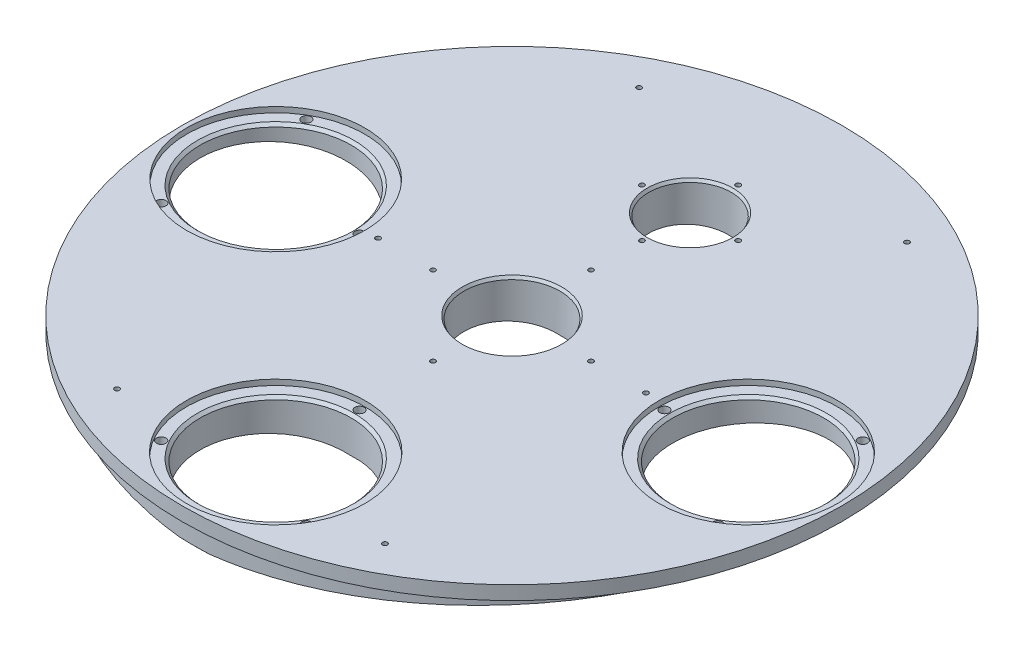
ISO-10303-21;
HEADER;
FILE_DESCRIPTION(('STEP AP214'),'2;1');
FILE_NAME('part.step','',(''),(''),'','','');
FILE_SCHEMA(('AUTOMOTIVE_DESIGN { 1 0 10303 214 1 1 1 1 }'));
ENDSEC;
DATA;
#1=APPLICATION_CONTEXT('core data for automotive mechanical design processes');
#2=APPLICATION_PROTOCOL_DEFINITION('international standard','automotive_design',2000,#1);
#3=PRODUCT_CONTEXT('',#1,'mechanical');
#4=PRODUCT('Part','Part','',(#3));
#5=PRODUCT_RELATED_PRODUCT_CATEGORY('part','',(#4));
#6=PRODUCT_DEFINITION_FORMATION('','',#4);
#7=PRODUCT_DEFINITION_CONTEXT('part definition',#1,'design');
#8=PRODUCT_DEFINITION('design','',#6,#7);
#9=PRODUCT_DEFINITION_SHAPE('','',#8);
#10=(LENGTH_UNIT() NAMED_UNIT(*) SI_UNIT(.MILLI.,.METRE.));
#11=(NAMED_UNIT(*) PLANE_ANGLE_UNIT() SI_UNIT($,.RADIAN.));
#12=(NAMED_UNIT(*) SI_UNIT($,.STERADIAN.) SOLID_ANGLE_UNIT());
#13=UNCERTAINTY_MEASURE_WITH_UNIT(LENGTH_MEASURE(1.E-05),#10,'distance_accuracy_value','');
#14=(GEOMETRIC_REPRESENTATION_CONTEXT(3) GLOBAL_UNCERTAINTY_ASSIGNED_CONTEXT((#13)) GLOBAL_UNIT_ASSIGNED_CONTEXT((#10,
#11,#12)) REPRESENTATION_CONTEXT('',''));
#15=CARTESIAN_POINT('',(0.,0.,0.));
#16=DIRECTION('',(0.,0.,1.));
#17=DIRECTION('',(1.,0.,0.));
#18=AXIS2_PLACEMENT_3D('',#15,#16,#17);
#19=CARTESIAN_POINT('',(-109.22,0.,0.));
#20=DIRECTION('',(0.,1.,0.));
#21=DIRECTION('',(0.,0.,1.));
#22=AXIS2_PLACEMENT_3D('',#19,#20,#21);
#23=CYLINDRICAL_SURFACE('',#22,34.925);
#24=CARTESIAN_POINT('',(-109.22,15.2399999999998,0.));
#25=DIRECTION('',(0.,1.,0.));
#26=DIRECTION('',(0.,0.,1.));
#27=AXIS2_PLACEMENT_3D('',#24,#25,#26);
#28=CIRCLE('',#27,34.925);
#29=CARTESIAN_POINT('',(-109.22,15.2399999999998,34.925));
#30=VERTEX_POINT('',#29);
#31=EDGE_CURVE('E338',#30,#30,#28,.T.);
#32=ORIENTED_EDGE('',*,*,#31,.T.);
#33=EDGE_LOOP('',(#32));
#34=FACE_BOUND('',#33,.T.);
#35=CARTESIAN_POINT('',(-109.22,7.63740640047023,0.));
#36=DIRECTION('',(0.0697564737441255,0.997564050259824,0.));
#37=DIRECTION('',(-0.997564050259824,0.0697564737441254,0.));
#38=AXIS2_PLACEMENT_3D('',#35,#36,#37);
#39=ELLIPSE('',#38,35.0102832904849,34.925);
#40=CARTESIAN_POINT('',(-144.145,10.0796003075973,0.));
#41=VERTEX_POINT('',#40);
#42=EDGE_CURVE('E223',#41,#41,#39,.T.);
#43=ORIENTED_EDGE('',*,*,#42,.F.);
#44=EDGE_LOOP('',(#43));
#45=FACE_BOUND('',#44,.T.);
#46=ADVANCED_FACE('F88',(#34,#45),#23,.F.);
#47=CARTESIAN_POINT('',(-128.5875,19.05,33.5454940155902));
#48=DIRECTION('',(0.,1.,0.));
#49=DIRECTION('',(0.,0.,1.));
#50=AXIS2_PLACEMENT_3D('',#47,#48,#49);
#51=CYLINDRICAL_SURFACE('',#50,2.15264999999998);
#52=CARTESIAN_POINT('',(-128.5875,8.99171393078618,33.5454940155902));
#53=DIRECTION('',(0.0697564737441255,0.997564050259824,0.));
#54=DIRECTION('',(-0.997564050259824,0.0697564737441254,0.));
#55=AXIS2_PLACEMENT_3D('',#52,#53,#54);
#56=ELLIPSE('',#55,2.15790655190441,2.15264999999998);
#57=CARTESIAN_POINT('',(-130.74015,9.14224188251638,33.5454940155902));
#58=VERTEX_POINT('',#57);
#59=EDGE_CURVE('E272',#58,#58,#56,.T.);
#60=ORIENTED_EDGE('',*,*,#59,.F.);
#61=EDGE_LOOP('',(#60));
#62=FACE_BOUND('',#61,.T.);
#63=CARTESIAN_POINT('',(-128.5875,16.51,33.5454940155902));
#64=DIRECTION('',(0.,1.,0.));
#65=DIRECTION('',(0.,0.,1.));
#66=AXIS2_PLACEMENT_3D('',#63,#64,#65);
#67=CIRCLE('',#66,2.15264999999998);
#68=CARTESIAN_POINT('',(-128.5875,16.51,35.6981440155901));
#69=VERTEX_POINT('',#68);
#70=EDGE_CURVE('E560',#69,#69,#67,.F.);
#71=ORIENTED_EDGE('',*,*,#70,.F.);
#72=EDGE_LOOP('',(#71));
#73=FACE_BOUND('',#72,.T.);
#74=ADVANCED_FACE('F362',(#62,#73),#51,.F.);
#75=CARTESIAN_POINT('',(-70.485,19.05,0.));
#76=DIRECTION('',(0.,1.,0.));
#77=DIRECTION('',(0.,0.,1.));
#78=AXIS2_PLACEMENT_3D('',#75,#76,#77);
#79=CYLINDRICAL_SURFACE('',#78,2.15264999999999);
#80=CARTESIAN_POINT('',(-70.485,4.92879133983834,0.));
#81=DIRECTION('',(0.0697564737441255,0.997564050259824,0.));
#82=DIRECTION('',(-0.997564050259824,0.0697564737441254,0.));
#83=AXIS2_PLACEMENT_3D('',#80,#81,#82);
#84=ELLIPSE('',#83,2.15790655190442,2.15264999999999);
#85=CARTESIAN_POINT('',(-72.63765,5.07931929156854,0.));
#86=VERTEX_POINT('',#85);
#87=EDGE_CURVE('E275',#86,#86,#84,.T.);
#88=ORIENTED_EDGE('',*,*,#87,.F.);
#89=EDGE_LOOP('',(#88));
#90=FACE_BOUND('',#89,.T.);
#91=CARTESIAN_POINT('',(-70.485,16.51,0.));
#92=DIRECTION('',(0.,1.,0.));
#93=DIRECTION('',(0.,0.,1.));
#94=AXIS2_PLACEMENT_3D('',#91,#92,#93);
#95=CIRCLE('',#94,2.15264999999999);
#96=CARTESIAN_POINT('',(-70.485,16.51,2.15264999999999));
#97=VERTEX_POINT('',#96);
#98=EDGE_CURVE('E331',#97,#97,#95,.F.);
#99=ORIENTED_EDGE('',*,*,#98,.F.);
#100=EDGE_LOOP('',(#99));
#101=FACE_BOUND('',#100,.T.);
#102=ADVANCED_FACE('F368',(#90,#101),#79,.F.);
#103=CARTESIAN_POINT('',(-128.5875,19.05,-33.5454940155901));
#104=DIRECTION('',(0.,1.,0.));
#105=DIRECTION('',(0.,0.,1.));
#106=AXIS2_PLACEMENT_3D('',#103,#104,#105);
#107=CYLINDRICAL_SURFACE('',#106,2.15264999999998);
#108=CARTESIAN_POINT('',(-128.5875,8.99171393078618,-33.5454940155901));
#109=DIRECTION('',(0.0697564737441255,0.997564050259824,0.));
#110=DIRECTION('',(-0.997564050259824,0.0697564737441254,0.));
#111=AXIS2_PLACEMENT_3D('',#108,#109,#110);
#112=ELLIPSE('',#111,2.15790655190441,2.15264999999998);
#113=CARTESIAN_POINT('',(-130.74015,9.14224188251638,-33.5454940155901));
#114=VERTEX_POINT('',#113);
#115=EDGE_CURVE('E278',#114,#114,#112,.T.);
#116=ORIENTED_EDGE('',*,*,#115,.F.);
#117=EDGE_LOOP('',(#116));
#118=FACE_BOUND('',#117,.T.);
#119=CARTESIAN_POINT('',(-128.5875,16.51,-33.5454940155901));
#120=DIRECTION('',(0.,1.,0.));
#121=DIRECTION('',(0.,0.,1.));
#122=AXIS2_PLACEMENT_3D('',#119,#120,#121);
#123=CIRCLE('',#122,2.15264999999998);
#124=CARTESIAN_POINT('',(-128.5875,16.51,-31.3928440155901));
#125=VERTEX_POINT('',#124);
#126=EDGE_CURVE('E328',#125,#125,#123,.F.);
#127=ORIENTED_EDGE('',*,*,#126,.F.);
#128=EDGE_LOOP('',(#127));
#129=FACE_BOUND('',#128,.T.);
#130=ADVANCED_FACE('F384',(#118,#129),#107,.F.);
#131=CARTESIAN_POINT('',(109.22,0.,0.));
#132=DIRECTION('',(0.,1.,0.));
#133=DIRECTION('',(0.,0.,1.));
#134=AXIS2_PLACEMENT_3D('',#131,#132,#133);
#135=CYLINDRICAL_SURFACE('',#134,34.925);
#136=CARTESIAN_POINT('',(109.22,15.2400000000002,0.));
#137=DIRECTION('',(0.,1.,0.));
#138=DIRECTION('',(0.,0.,1.));
#139=AXIS2_PLACEMENT_3D('',#136,#137,#138);
#140=CIRCLE('',#139,34.925);
#141=CARTESIAN_POINT('',(109.22,15.2400000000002,34.925));
#142=VERTEX_POINT('',#141);
#143=EDGE_CURVE('E335',#142,#142,#140,.T.);
#144=ORIENTED_EDGE('',*,*,#143,.T.);
#145=EDGE_LOOP('',(#144));
#146=FACE_BOUND('',#145,.T.);
#147=CARTESIAN_POINT('',(109.22,7.63740640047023,0.));
#148=DIRECTION('',(0.0697564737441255,-0.997564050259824,0.));
#149=DIRECTION('',(0.997564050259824,0.0697564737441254,0.));
#150=AXIS2_PLACEMENT_3D('',#147,#148,#149);
#151=ELLIPSE('',#150,35.0102832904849,34.925);
#152=CARTESIAN_POINT('',(144.145,10.0796003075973,0.));
#153=VERTEX_POINT('',#152);
#154=EDGE_CURVE('E226',#153,#153,#151,.F.);
#155=ORIENTED_EDGE('',*,*,#154,.F.);
#156=EDGE_LOOP('',(#155));
#157=FACE_BOUND('',#156,.T.);
#158=ADVANCED_FACE('F380',(#146,#157),#135,.F.);
#159=CARTESIAN_POINT('',(128.5875,19.05,33.5454940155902));
#160=DIRECTION('',(0.,1.,0.));
#161=DIRECTION('',(0.,0.,1.));
#162=AXIS2_PLACEMENT_3D('',#159,#160,#161);
#163=CYLINDRICAL_SURFACE('',#162,2.15264999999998);
#164=CARTESIAN_POINT('',(128.5875,8.99171393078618,33.5454940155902));
#165=DIRECTION('',(0.0697564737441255,-0.997564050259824,0.));
#166=DIRECTION('',(0.997564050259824,0.0697564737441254,0.));
#167=AXIS2_PLACEMENT_3D('',#164,#165,#166);
#168=ELLIPSE('',#167,2.15790655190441,2.15264999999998);
#169=CARTESIAN_POINT('',(130.74015,9.14224188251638,33.5454940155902));
#170=VERTEX_POINT('',#169);
#171=EDGE_CURVE('E281',#170,#170,#168,.T.);
#172=ORIENTED_EDGE('',*,*,#171,.T.);
#173=EDGE_LOOP('',(#172));
#174=FACE_BOUND('',#173,.T.);
#175=CARTESIAN_POINT('',(128.5875,16.51,33.5454940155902));
#176=DIRECTION('',(0.,1.,0.));
#177=DIRECTION('',(0.,0.,1.));
#178=AXIS2_PLACEMENT_3D('',#175,#176,#177);
#179=CIRCLE('',#178,2.15264999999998);
#180=CARTESIAN_POINT('',(128.5875,16.51,35.6981440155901));
#181=VERTEX_POINT('',#180);
#182=EDGE_CURVE('E552',#181,#181,#179,.F.);
#183=ORIENTED_EDGE('',*,*,#182,.F.);
#184=EDGE_LOOP('',(#183));
#185=FACE_BOUND('',#184,.T.);
#186=ADVANCED_FACE('F383',(#174,#185),#163,.F.);
#187=CARTESIAN_POINT('',(70.485,19.05,0.));
#188=DIRECTION('',(0.,1.,0.));
#189=DIRECTION('',(0.,0.,1.));
#190=AXIS2_PLACEMENT_3D('',#187,#188,#189);
#191=CYLINDRICAL_SURFACE('',#190,2.15264999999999);
#192=CARTESIAN_POINT('',(70.485,4.92879133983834,0.));
#193=DIRECTION('',(0.0697564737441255,-0.997564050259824,0.));
#194=DIRECTION('',(0.997564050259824,0.0697564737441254,0.));
#195=AXIS2_PLACEMENT_3D('',#192,#193,#194);
#196=ELLIPSE('',#195,2.15790655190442,2.15264999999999);
#197=CARTESIAN_POINT('',(72.63765,5.07931929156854,0.));
#198=VERTEX_POINT('',#197);
#199=EDGE_CURVE('E284',#198,#198,#196,.T.);
#200=ORIENTED_EDGE('',*,*,#199,.T.);
#201=EDGE_LOOP('',(#200));
#202=FACE_BOUND('',#201,.T.);
#203=CARTESIAN_POINT('',(70.485,16.51,0.));
#204=DIRECTION('',(0.,1.,0.));
#205=DIRECTION('',(0.,0.,1.));
#206=AXIS2_PLACEMENT_3D('',#203,#204,#205);
#207=CIRCLE('',#206,2.15264999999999);
#208=CARTESIAN_POINT('',(70.485,16.51,2.15264999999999));
#209=VERTEX_POINT('',#208);
#210=EDGE_CURVE('E326',#209,#209,#207,.F.);
#211=ORIENTED_EDGE('',*,*,#210,.F.);
#212=EDGE_LOOP('',(#211));
#213=FACE_BOUND('',#212,.T.);
#214=ADVANCED_FACE('F633',(#202,#213),#191,.F.);
#215=CARTESIAN_POINT('',(128.5875,19.05,-33.5454940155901));
#216=DIRECTION('',(0.,1.,0.));
#217=DIRECTION('',(0.,0.,1.));
#218=AXIS2_PLACEMENT_3D('',#215,#216,#217);
#219=CYLINDRICAL_SURFACE('',#218,2.15264999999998);
#220=CARTESIAN_POINT('',(128.5875,8.99171393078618,-33.5454940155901));
#221=DIRECTION('',(0.0697564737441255,-0.997564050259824,0.));
#222=DIRECTION('',(0.997564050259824,0.0697564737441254,0.));
#223=AXIS2_PLACEMENT_3D('',#220,#221,#222);
#224=ELLIPSE('',#223,2.15790655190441,2.15264999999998);
#225=CARTESIAN_POINT('',(130.74015,9.14224188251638,-33.5454940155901));
#226=VERTEX_POINT('',#225);
#227=EDGE_CURVE('E185',#226,#226,#224,.T.);
#228=ORIENTED_EDGE('',*,*,#227,.T.);
#229=EDGE_LOOP('',(#228));
#230=FACE_BOUND('',#229,.T.);
#231=CARTESIAN_POINT('',(128.5875,16.51,-33.5454940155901));
#232=DIRECTION('',(0.,1.,0.));
#233=DIRECTION('',(0.,0.,1.));
#234=AXIS2_PLACEMENT_3D('',#231,#232,#233);
#235=CIRCLE('',#234,2.15264999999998);
#236=CARTESIAN_POINT('',(128.5875,16.51,-31.3928440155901));
#237=VERTEX_POINT('',#236);
#238=EDGE_CURVE('E323',#237,#237,#235,.F.);
#239=ORIENTED_EDGE('',*,*,#238,.F.);
#240=EDGE_LOOP('',(#239));
#241=FACE_BOUND('',#240,.T.);
#242=ADVANCED_FACE('F378',(#230,#241),#219,.F.);
#243=CARTESIAN_POINT('',(0.,0.,109.22));
#244=DIRECTION('',(0.,1.,0.));
#245=DIRECTION('',(0.,0.,1.));
#246=AXIS2_PLACEMENT_3D('',#243,#244,#245);
#247=CYLINDRICAL_SURFACE('',#246,34.925);
#248=CARTESIAN_POINT('',(0.,15.2400000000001,109.22));
#249=DIRECTION('',(0.,1.,0.));
#250=DIRECTION('',(0.,0.,1.));
#251=AXIS2_PLACEMENT_3D('',#248,#249,#250);
#252=CIRCLE('',#251,34.925);
#253=CARTESIAN_POINT('',(0.,15.2400000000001,144.145));
#254=VERTEX_POINT('',#253);
#255=EDGE_CURVE('E12',#254,#254,#252,.T.);
#256=ORIENTED_EDGE('',*,*,#255,.T.);
#257=EDGE_LOOP('',(#256));
#258=FACE_BOUND('',#257,.T.);
#259=CARTESIAN_POINT('',(0.,0.,109.22));
#260=DIRECTION('',(0.0697564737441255,-0.997564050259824,0.));
#261=DIRECTION('',(0.997564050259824,0.0697564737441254,0.));
#262=AXIS2_PLACEMENT_3D('',#259,#260,#261);
#263=ELLIPSE('',#262,35.0102832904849,34.925);
#264=CARTESIAN_POINT('',(0.,0.,144.145));
#265=VERTEX_POINT('',#264);
#266=CARTESIAN_POINT('',(0.,0.,74.295));
#267=VERTEX_POINT('',#266);
#268=EDGE_CURVE('E191',#265,#267,#263,.F.);
#269=ORIENTED_EDGE('',*,*,#268,.F.);
#270=CARTESIAN_POINT('',(0.,0.,109.22));
#271=DIRECTION('',(0.0697564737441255,0.997564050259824,0.));
#272=DIRECTION('',(-0.997564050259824,0.0697564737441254,0.));
#273=AXIS2_PLACEMENT_3D('',#270,#271,#272);
#274=ELLIPSE('',#273,35.0102832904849,34.925);
#275=EDGE_CURVE('E199',#265,#267,#274,.F.);
#276=ORIENTED_EDGE('',*,*,#275,.T.);
#277=EDGE_LOOP('',(#269,#276));
#278=FACE_BOUND('',#277,.T.);
#279=ADVANCED_FACE('F375',(#258,#278),#247,.F.);
#280=CARTESIAN_POINT('',(4.00984311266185E-13,19.05,70.485));
#281=DIRECTION('',(0.,1.,0.));
#282=DIRECTION('',(0.,0.,1.));
#283=AXIS2_PLACEMENT_3D('',#280,#281,#282);
#284=CYLINDRICAL_SURFACE('',#283,2.15264999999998);
#285=CARTESIAN_POINT('',(4.00984311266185E-13,0.,70.485));
#286=DIRECTION('',(0.0697564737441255,-0.997564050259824,0.));
#287=DIRECTION('',(0.997564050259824,0.0697564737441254,0.));
#288=AXIS2_PLACEMENT_3D('',#285,#286,#287);
#289=ELLIPSE('',#288,2.15790655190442,2.15264999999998);
#290=CARTESIAN_POINT('',(0.,0.,68.33235));
#291=VERTEX_POINT('',#290);
#292=CARTESIAN_POINT('',(-1.44734294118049E-13,0.,72.63765));
#293=VERTEX_POINT('',#292);
#294=EDGE_CURVE('E169',#291,#293,#289,.T.);
#295=ORIENTED_EDGE('',*,*,#294,.T.);
#296=CARTESIAN_POINT('',(4.00984311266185E-13,0.,70.485));
#297=DIRECTION('',(0.0697564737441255,0.997564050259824,0.));
#298=DIRECTION('',(-0.997564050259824,0.0697564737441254,0.));
#299=AXIS2_PLACEMENT_3D('',#296,#297,#298);
#300=ELLIPSE('',#299,2.15790655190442,2.15264999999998);
#301=EDGE_CURVE('E102',#291,#293,#300,.T.);
#302=ORIENTED_EDGE('',*,*,#301,.F.);
#303=EDGE_LOOP('',(#295,#302));
#304=FACE_BOUND('',#303,.T.);
#305=CARTESIAN_POINT('',(4.00984311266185E-13,16.51,70.485));
#306=DIRECTION('',(0.,1.,0.));
#307=DIRECTION('',(0.,0.,1.));
#308=AXIS2_PLACEMENT_3D('',#305,#306,#307);
#309=CIRCLE('',#308,2.15264999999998);
#310=CARTESIAN_POINT('',(4.00984311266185E-13,16.51,72.63765));
#311=VERTEX_POINT('',#310);
#312=EDGE_CURVE('E544',#311,#311,#309,.F.);
#313=ORIENTED_EDGE('',*,*,#312,.F.);
#314=EDGE_LOOP('',(#313));
#315=FACE_BOUND('',#314,.T.);
#316=ADVANCED_FACE('F170',(#304,#315),#284,.F.);
#317=CARTESIAN_POINT('',(-33.5454940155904,19.05,128.5875));
#318=DIRECTION('',(0.,1.,0.));
#319=DIRECTION('',(0.,0.,1.));
#320=AXIS2_PLACEMENT_3D('',#317,#318,#319);
#321=CYLINDRICAL_SURFACE('',#320,2.15264999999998);
#322=CARTESIAN_POINT('',(-33.5454940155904,2.34572945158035,128.5875));
#323=DIRECTION('',(0.0697564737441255,0.997564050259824,0.));
#324=DIRECTION('',(-0.997564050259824,0.0697564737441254,0.));
#325=AXIS2_PLACEMENT_3D('',#322,#323,#324);
#326=ELLIPSE('',#325,2.15790655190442,2.15264999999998);
#327=CARTESIAN_POINT('',(-35.6981440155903,2.49625740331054,128.5875));
#328=VERTEX_POINT('',#327);
#329=EDGE_CURVE('E186',#328,#328,#326,.T.);
#330=ORIENTED_EDGE('',*,*,#329,.F.);
#331=EDGE_LOOP('',(#330));
#332=FACE_BOUND('',#331,.T.);
#333=CARTESIAN_POINT('',(-33.5454940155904,16.51,128.5875));
#334=DIRECTION('',(0.,1.,0.));
#335=DIRECTION('',(0.,0.,1.));
#336=AXIS2_PLACEMENT_3D('',#333,#334,#335);
#337=CIRCLE('',#336,2.15264999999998);
#338=CARTESIAN_POINT('',(-33.5454940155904,16.51,130.74015));
#339=VERTEX_POINT('',#338);
#340=EDGE_CURVE('E321',#339,#339,#337,.F.);
#341=ORIENTED_EDGE('',*,*,#340,.F.);
#342=EDGE_LOOP('',(#341));
#343=FACE_BOUND('',#342,.T.);
#344=ADVANCED_FACE('F624',(#332,#343),#321,.F.);
#345=CARTESIAN_POINT('',(33.5454940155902,19.05,128.5875));
#346=DIRECTION('',(0.,1.,0.));
#347=DIRECTION('',(0.,0.,1.));
#348=AXIS2_PLACEMENT_3D('',#345,#346,#347);
#349=CYLINDRICAL_SURFACE('',#348,2.15264999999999);
#350=CARTESIAN_POINT('',(33.5454940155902,2.34572945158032,128.5875));
#351=DIRECTION('',(0.0697564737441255,-0.997564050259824,0.));
#352=DIRECTION('',(0.997564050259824,0.0697564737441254,0.));
#353=AXIS2_PLACEMENT_3D('',#350,#351,#352);
#354=ELLIPSE('',#353,2.15790655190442,2.15264999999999);
#355=CARTESIAN_POINT('',(35.6981440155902,2.49625740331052,128.5875));
#356=VERTEX_POINT('',#355);
#357=EDGE_CURVE('E291',#356,#356,#354,.T.);
#358=ORIENTED_EDGE('',*,*,#357,.T.);
#359=EDGE_LOOP('',(#358));
#360=FACE_BOUND('',#359,.T.);
#361=CARTESIAN_POINT('',(33.5454940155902,16.51,128.5875));
#362=DIRECTION('',(0.,1.,0.));
#363=DIRECTION('',(0.,0.,1.));
#364=AXIS2_PLACEMENT_3D('',#361,#362,#363);
#365=CIRCLE('',#364,2.15264999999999);
#366=CARTESIAN_POINT('',(33.5454940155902,16.51,130.74015));
#367=VERTEX_POINT('',#366);
#368=EDGE_CURVE('E318',#367,#367,#365,.F.);
#369=ORIENTED_EDGE('',*,*,#368,.F.);
#370=EDGE_LOOP('',(#369));
#371=FACE_BOUND('',#370,.T.);
#372=ADVANCED_FACE('F399',(#360,#371),#349,.F.);
#373=CARTESIAN_POINT('',(0.,12.7,0.));
#374=DIRECTION('',(0.,-1.,0.));
#375=DIRECTION('',(0.,0.,-1.));
#376=AXIS2_PLACEMENT_3D('',#373,#374,#375);
#377=CYLINDRICAL_SURFACE('',#376,147.066);
#378=CARTESIAN_POINT('',(0.,12.446,0.));
#379=DIRECTION('',(0.,1.,0.));
#380=DIRECTION('',(0.,0.,1.));
#381=AXIS2_PLACEMENT_3D('',#378,#379,#380);
#382=CIRCLE('',#381,147.066);
#383=CARTESIAN_POINT('',(0.,12.446,147.066));
#384=VERTEX_POINT('',#383);
#385=EDGE_CURVE('E215',#384,#384,#382,.F.);
#386=ORIENTED_EDGE('',*,*,#385,.T.);
#387=EDGE_LOOP('',(#386));
#388=FACE_BOUND('',#387,.T.);
#389=CARTESIAN_POINT('',(0.,0.,0.));
#390=DIRECTION('',(0.0697564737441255,-0.997564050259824,0.));
#391=DIRECTION('',(-0.997564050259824,-0.0697564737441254,0.));
#392=AXIS2_PLACEMENT_3D('',#389,#390,#391);
#393=ELLIPSE('',#392,147.425120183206,147.066);
#394=CARTESIAN_POINT('',(7.26473845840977,0.508000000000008,-146.886459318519));
#395=VERTEX_POINT('',#394);
#396=CARTESIAN_POINT('',(7.26473845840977,0.508000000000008,146.886459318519));
#397=VERTEX_POINT('',#396);
#398=EDGE_CURVE('E490',#395,#397,#393,.T.);
#399=ORIENTED_EDGE('',*,*,#398,.F.);
#400=CARTESIAN_POINT('',(0.,0.508000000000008,0.));
#401=DIRECTION('',(0.,1.,0.));
#402=DIRECTION('',(0.,0.,1.));
#403=AXIS2_PLACEMENT_3D('',#400,#401,#402);
#404=CIRCLE('',#403,147.066);
#405=CARTESIAN_POINT('',(-7.26473845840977,0.508000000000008,-146.886459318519));
#406=VERTEX_POINT('',#405);
#407=EDGE_CURVE('E218',#395,#406,#404,.T.);
#408=ORIENTED_EDGE('',*,*,#407,.T.);
#409=CARTESIAN_POINT('',(0.,0.,0.));
#410=DIRECTION('',(0.0697564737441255,0.997564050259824,0.));
#411=DIRECTION('',(0.997564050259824,-0.0697564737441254,0.));
#412=AXIS2_PLACEMENT_3D('',#409,#410,#411);
#413=ELLIPSE('',#412,147.425120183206,147.066);
#414=CARTESIAN_POINT('',(-7.26473845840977,0.508000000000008,146.886459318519));
#415=VERTEX_POINT('',#414);
#416=EDGE_CURVE('E203',#406,#415,#413,.T.);
#417=ORIENTED_EDGE('',*,*,#416,.T.);
#418=EDGE_CURVE('E219',#415,#397,#404,.T.);
#419=ORIENTED_EDGE('',*,*,#418,.T.);
#420=EDGE_LOOP('',(#399,#408,#417,#419));
#421=FACE_BOUND('',#420,.T.);
#422=ADVANCED_FACE('F390',(#388,#421),#377,.T.);
#423=CARTESIAN_POINT('',(0.,0.508000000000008,0.));
#424=DIRECTION('',(0.,1.,0.));
#425=DIRECTION('',(0.,0.,1.));
#426=AXIS2_PLACEMENT_3D('',#423,#424,#425);
#427=CONICAL_SURFACE('',#426,147.066,0.785398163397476);
#428=ORIENTED_EDGE('',*,*,#407,.F.);
#429=CARTESIAN_POINT('',(10.2986918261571,0.720154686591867,0.));
#430=DIRECTION('',(0.0697564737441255,-0.997564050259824,0.));
#431=DIRECTION('',(0.997564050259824,0.0697564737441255,0.));
#432=AXIS2_PLACEMENT_3D('',#429,#430,#431);
#433=ELLIPSE('',#432,147.63779292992,146.917636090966);
#434=CARTESIAN_POINT('',(0.,0.,-146.558));
#435=VERTEX_POINT('',#434);
#436=EDGE_CURVE('E487',#395,#435,#433,.F.);
#437=ORIENTED_EDGE('',*,*,#436,.T.);
#438=CARTESIAN_POINT('',(-10.2986918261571,0.720154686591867,0.));
#439=DIRECTION('',(0.0697564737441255,0.997564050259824,0.));
#440=DIRECTION('',(-0.997564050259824,0.0697564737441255,0.));
#441=AXIS2_PLACEMENT_3D('',#438,#439,#440);
#442=ELLIPSE('',#441,147.63779292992,146.917636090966);
#443=EDGE_CURVE('E202',#406,#435,#442,.F.);
#444=ORIENTED_EDGE('',*,*,#443,.F.);
#445=EDGE_LOOP('',(#428,#437,#444));
#446=FACE_BOUND('',#445,.T.);
#447=ADVANCED_FACE('F386',(#446),#427,.T.);
#448=CARTESIAN_POINT('',(0.,0.,146.558));
#449=VERTEX_POINT('',#448);
#450=EDGE_CURVE('E194',#449,#415,#442,.F.);
#451=ORIENTED_EDGE('',*,*,#450,.F.);
#452=EDGE_CURVE('E491',#449,#397,#433,.F.);
#453=ORIENTED_EDGE('',*,*,#452,.T.);
#454=ORIENTED_EDGE('',*,*,#418,.F.);
#455=EDGE_LOOP('',(#451,#453,#454));
#456=FACE_BOUND('',#455,.T.);
#457=ADVANCED_FACE('F389',(#456),#427,.T.);
#458=CARTESIAN_POINT('',(0.,19.05,0.));
#459=DIRECTION('',(0.,1.,0.));
#460=DIRECTION('',(0.,0.,1.));
#461=AXIS2_PLACEMENT_3D('',#458,#459,#460);
#462=PLANE('',#461);
#463=CARTESIAN_POINT('',(-109.22,19.05,0.));
#464=DIRECTION('',(0.,1.,0.));
#465=DIRECTION('',(0.,0.,1.));
#466=AXIS2_PLACEMENT_3D('',#463,#464,#465);
#467=CIRCLE('',#466,41.148);
#468=CARTESIAN_POINT('',(-109.22,19.05,41.148));
#469=VERTEX_POINT('',#468);
#470=EDGE_CURVE('E415',#469,#469,#467,.T.);
#471=ORIENTED_EDGE('',*,*,#470,.F.);
#472=EDGE_LOOP('',(#471));
#473=FACE_BOUND('',#472,.T.);
#474=CARTESIAN_POINT('',(109.22,19.05,0.));
#475=DIRECTION('',(0.,1.,0.));
#476=DIRECTION('',(0.,0.,1.));
#477=AXIS2_PLACEMENT_3D('',#474,#475,#476);
#478=CIRCLE('',#477,41.275);
#479=CARTESIAN_POINT('',(109.22,19.05,41.275));
#480=VERTEX_POINT('',#479);
#481=EDGE_CURVE('E419',#480,#480,#478,.T.);
#482=ORIENTED_EDGE('',*,*,#481,.F.);
#483=EDGE_LOOP('',(#482));
#484=FACE_BOUND('',#483,.T.);
#485=CARTESIAN_POINT('',(0.,19.05,109.22));
#486=DIRECTION('',(0.,1.,0.));
#487=DIRECTION('',(0.,0.,1.));
#488=AXIS2_PLACEMENT_3D('',#485,#486,#487);
#489=CIRCLE('',#488,41.275);
#490=CARTESIAN_POINT('',(0.,19.05,150.495));
#491=VERTEX_POINT('',#490);
#492=EDGE_CURVE('E423',#491,#491,#489,.T.);
#493=ORIENTED_EDGE('',*,*,#492,.F.);
#494=EDGE_LOOP('',(#493));
#495=FACE_BOUND('',#494,.T.);
#496=CARTESIAN_POINT('',(-61.9252,19.05,120.65));
#497=DIRECTION('',(0.,1.,0.));
#498=DIRECTION('',(0.,0.,1.));
#499=AXIS2_PLACEMENT_3D('',#496,#497,#498);
#500=CIRCLE('',#499,1.13029999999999);
#501=CARTESIAN_POINT('',(-61.9252,19.05,121.7803));
#502=VERTEX_POINT('',#501);
#503=EDGE_CURVE('E317',#502,#502,#500,.T.);
#504=ORIENTED_EDGE('',*,*,#503,.F.);
#505=EDGE_LOOP('',(#504));
#506=FACE_BOUND('',#505,.T.);
#507=CARTESIAN_POINT('',(-61.9252,19.05,0.));
#508=DIRECTION('',(0.,1.,0.));
#509=DIRECTION('',(0.,0.,1.));
#510=AXIS2_PLACEMENT_3D('',#507,#508,#509);
#511=CIRCLE('',#510,1.13029999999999);
#512=CARTESIAN_POINT('',(-61.9252,19.05,1.13029999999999));
#513=VERTEX_POINT('',#512);
#514=EDGE_CURVE('E313',#513,#513,#511,.T.);
#515=ORIENTED_EDGE('',*,*,#514,.F.);
#516=EDGE_LOOP('',(#515));
#517=FACE_BOUND('',#516,.T.);
#518=CARTESIAN_POINT('',(-61.9252,19.05,-120.65));
#519=DIRECTION('',(0.,1.,0.));
#520=DIRECTION('',(0.,0.,1.));
#521=AXIS2_PLACEMENT_3D('',#518,#519,#520);
#522=CIRCLE('',#521,1.13029999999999);
#523=CARTESIAN_POINT('',(-61.9252,19.05,-119.5197));
#524=VERTEX_POINT('',#523);
#525=EDGE_CURVE('E309',#524,#524,#522,.T.);
#526=ORIENTED_EDGE('',*,*,#525,.F.);
#527=EDGE_LOOP('',(#526));
#528=FACE_BOUND('',#527,.T.);
#529=CARTESIAN_POINT('',(61.9252,19.05,120.65));
#530=DIRECTION('',(0.,1.,0.));
#531=DIRECTION('',(0.,0.,1.));
#532=AXIS2_PLACEMENT_3D('',#529,#530,#531);
#533=CIRCLE('',#532,1.13029999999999);
#534=CARTESIAN_POINT('',(61.9252,19.05,121.7803));
#535=VERTEX_POINT('',#534);
#536=EDGE_CURVE('E305',#535,#535,#533,.T.);
#537=ORIENTED_EDGE('',*,*,#536,.F.);
#538=EDGE_LOOP('',(#537));
#539=FACE_BOUND('',#538,.T.);
#540=CARTESIAN_POINT('',(61.9252,19.05,0.));
#541=DIRECTION('',(0.,1.,0.));
#542=DIRECTION('',(0.,0.,1.));
#543=AXIS2_PLACEMENT_3D('',#540,#541,#542);
#544=CIRCLE('',#543,1.13029999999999);
#545=CARTESIAN_POINT('',(61.9252,19.05,1.13029999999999));
#546=VERTEX_POINT('',#545);
#547=EDGE_CURVE('E301',#546,#546,#544,.T.);
#548=ORIENTED_EDGE('',*,*,#547,.F.);
#549=EDGE_LOOP('',(#548));
#550=FACE_BOUND('',#549,.T.);
#551=CARTESIAN_POINT('',(61.9252,19.05,-120.65));
#552=DIRECTION('',(0.,1.,0.));
#553=DIRECTION('',(0.,0.,1.));
#554=AXIS2_PLACEMENT_3D('',#551,#552,#553);
#555=CIRCLE('',#554,1.13029999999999);
#556=CARTESIAN_POINT('',(61.9252,19.05,-119.5197));
#557=VERTEX_POINT('',#556);
#558=EDGE_CURVE('E297',#557,#557,#555,.T.);
#559=ORIENTED_EDGE('',*,*,#558,.F.);
#560=EDGE_LOOP('',(#559));
#561=FACE_BOUND('',#560,.T.);
#562=CARTESIAN_POINT('',(36.5125,19.05,-3.82448358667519E-13));
#563=DIRECTION('',(0.,1.,0.));
#564=DIRECTION('',(0.,0.,1.));
#565=AXIS2_PLACEMENT_3D('',#562,#563,#564);
#566=CIRCLE('',#565,1.13029999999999);
#567=CARTESIAN_POINT('',(36.5125,19.05,1.1302999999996));
#568=VERTEX_POINT('',#567);
#569=EDGE_CURVE('E271',#568,#568,#566,.T.);
#570=ORIENTED_EDGE('',*,*,#569,.F.);
#571=EDGE_LOOP('',(#570));
#572=FACE_BOUND('',#571,.T.);
#573=CARTESIAN_POINT('',(2.54965572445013E-13,19.05,36.5125));
#574=DIRECTION('',(0.,1.,0.));
#575=DIRECTION('',(0.,0.,1.));
#576=AXIS2_PLACEMENT_3D('',#573,#574,#575);
#577=CIRCLE('',#576,1.13029999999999);
#578=CARTESIAN_POINT('',(2.54965572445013E-13,19.05,37.6428));
#579=VERTEX_POINT('',#578);
#580=EDGE_CURVE('E270',#579,#579,#577,.T.);
#581=ORIENTED_EDGE('',*,*,#580,.F.);
#582=EDGE_LOOP('',(#581));
#583=FACE_BOUND('',#582,.T.);
#584=CARTESIAN_POINT('',(-36.5125,19.05,1.27482786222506E-13));
#585=DIRECTION('',(0.,1.,0.));
#586=DIRECTION('',(0.,0.,1.));
#587=AXIS2_PLACEMENT_3D('',#584,#585,#586);
#588=CIRCLE('',#587,1.13029999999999);
#589=CARTESIAN_POINT('',(-36.5125,19.05,1.13030000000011));
#590=VERTEX_POINT('',#589);
#591=EDGE_CURVE('E265',#590,#590,#588,.T.);
#592=ORIENTED_EDGE('',*,*,#591,.F.);
#593=EDGE_LOOP('',(#592));
#594=FACE_BOUND('',#593,.T.);
#595=CARTESIAN_POINT('',(0.,19.05,-36.5125));
#596=DIRECTION('',(0.,1.,0.));
#597=DIRECTION('',(0.,0.,1.));
#598=AXIS2_PLACEMENT_3D('',#595,#596,#597);
#599=CIRCLE('',#598,1.13029999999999);
#600=CARTESIAN_POINT('',(0.,19.05,-35.3822));
#601=VERTEX_POINT('',#600);
#602=EDGE_CURVE('E264',#601,#601,#599,.T.);
#603=ORIENTED_EDGE('',*,*,#602,.F.);
#604=EDGE_LOOP('',(#603));
#605=FACE_BOUND('',#604,.T.);
#606=CARTESIAN_POINT('',(0.,19.05,0.));
#607=DIRECTION('',(0.,1.,0.));
#608=DIRECTION('',(0.,0.,1.));
#609=AXIS2_PLACEMENT_3D('',#606,#607,#608);
#610=CIRCLE('',#609,22.9870000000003);
#611=CARTESIAN_POINT('',(0.,19.05,22.9870000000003));
#612=VERTEX_POINT('',#611);
#613=EDGE_CURVE('E256',#612,#612,#610,.F.);
#614=ORIENTED_EDGE('',*,*,#613,.T.);
#615=EDGE_LOOP('',(#614));
#616=FACE_BOUND('',#615,.T.);
#617=CARTESIAN_POINT('',(0.,19.05,-82.296));
#618=DIRECTION('',(0.,1.,0.));
#619=DIRECTION('',(0.,0.,1.));
#620=AXIS2_PLACEMENT_3D('',#617,#618,#619);
#621=CIRCLE('',#620,19.8120000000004);
#622=CARTESIAN_POINT('',(0.,19.05,-62.4839999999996));
#623=VERTEX_POINT('',#622);
#624=EDGE_CURVE('E250',#623,#623,#621,.F.);
#625=ORIENTED_EDGE('',*,*,#624,.T.);
#626=EDGE_LOOP('',(#625));
#627=FACE_BOUND('',#626,.T.);
#628=CARTESIAN_POINT('',(22.225,19.05,-82.2960000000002));
#629=DIRECTION('',(0.,1.,0.));
#630=DIRECTION('',(0.,0.,1.));
#631=AXIS2_PLACEMENT_3D('',#628,#629,#630);
#632=CIRCLE('',#631,1.1303);
#633=CARTESIAN_POINT('',(22.225,19.05,-81.1657000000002));
#634=VERTEX_POINT('',#633);
#635=EDGE_CURVE('E247',#634,#634,#632,.T.);
#636=ORIENTED_EDGE('',*,*,#635,.F.);
#637=EDGE_LOOP('',(#636));
#638=FACE_BOUND('',#637,.T.);
#639=CARTESIAN_POINT('',(1.55196435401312E-13,19.05,-60.071));
#640=DIRECTION('',(0.,1.,0.));
#641=DIRECTION('',(0.,0.,1.));
#642=AXIS2_PLACEMENT_3D('',#639,#640,#641);
#643=CIRCLE('',#642,1.1303);
#644=CARTESIAN_POINT('',(1.55196435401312E-13,19.05,-58.9407));
#645=VERTEX_POINT('',#644);
#646=EDGE_CURVE('E246',#645,#645,#643,.T.);
#647=ORIENTED_EDGE('',*,*,#646,.F.);
#648=EDGE_LOOP('',(#647));
#649=FACE_BOUND('',#648,.T.);
#650=CARTESIAN_POINT('',(-22.225,19.05,-82.2959999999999));
#651=DIRECTION('',(0.,1.,0.));
#652=DIRECTION('',(0.,0.,1.));
#653=AXIS2_PLACEMENT_3D('',#650,#651,#652);
#654=CIRCLE('',#653,1.1303);
#655=CARTESIAN_POINT('',(-22.225,19.05,-81.1656999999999));
#656=VERTEX_POINT('',#655);
#657=EDGE_CURVE('E239',#656,#656,#654,.T.);
#658=ORIENTED_EDGE('',*,*,#657,.F.);
#659=EDGE_LOOP('',(#658));
#660=FACE_BOUND('',#659,.T.);
#661=CARTESIAN_POINT('',(0.,19.05,-104.521));
#662=DIRECTION('',(0.,1.,0.));
#663=DIRECTION('',(0.,0.,1.));
#664=AXIS2_PLACEMENT_3D('',#661,#662,#663);
#665=CIRCLE('',#664,1.1303);
#666=CARTESIAN_POINT('',(0.,19.05,-103.3907));
#667=VERTEX_POINT('',#666);
#668=EDGE_CURVE('E238',#667,#667,#665,.T.);
#669=ORIENTED_EDGE('',*,*,#668,.F.);
#670=EDGE_LOOP('',(#669));
#671=FACE_BOUND('',#670,.T.);
#672=CARTESIAN_POINT('',(0.,19.05,0.));
#673=DIRECTION('',(0.,1.,0.));
#674=DIRECTION('',(0.,0.,1.));
#675=AXIS2_PLACEMENT_3D('',#672,#673,#674);
#676=CIRCLE('',#675,152.4);
#677=CARTESIAN_POINT('',(0.,19.05,-152.4));
#678=VERTEX_POINT('',#677);
#679=EDGE_CURVE('E207',#678,#678,#676,.T.);
#680=ORIENTED_EDGE('',*,*,#679,.T.);
#681=EDGE_LOOP('',(#680));
#682=FACE_BOUND('',#681,.T.);
#683=ADVANCED_FACE('F403',(#473,#484,#495,#506,#517,#528,#539,#550,#561,#572,#583,#594,#605,
#616,#627,#638,#649,#660,#671,#682),#462,.T.);
#684=CARTESIAN_POINT('',(0.,19.05,0.));
#685=DIRECTION('',(0.,-1.,0.));
#686=DIRECTION('',(0.,0.,-1.));
#687=AXIS2_PLACEMENT_3D('',#684,#685,#686);
#688=CYLINDRICAL_SURFACE('',#687,152.4);
#689=CARTESIAN_POINT('',(0.,12.7,0.));
#690=DIRECTION('',(0.,1.,0.));
#691=DIRECTION('',(0.,0.,1.));
#692=AXIS2_PLACEMENT_3D('',#689,#690,#691);
#693=CIRCLE('',#692,152.4);
#694=CARTESIAN_POINT('',(0.,12.7,-152.4));
#695=VERTEX_POINT('',#694);
#696=EDGE_CURVE('E206',#695,#695,#693,.T.);
#697=CARTESIAN_POINT('',(0.,12.7,-152.4));
#698=CARTESIAN_POINT('',(0.,12.7661458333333,-152.4));
#699=CARTESIAN_POINT('',(0.,12.8322916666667,-152.4));
#700=CARTESIAN_POINT('',(0.,12.9645833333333,-152.4));
#701=CARTESIAN_POINT('',(0.,13.0307291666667,-152.4));
#702=CARTESIAN_POINT('',(0.,13.1630208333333,-152.4));
#703=CARTESIAN_POINT('',(0.,13.2291666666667,-152.4));
#704=CARTESIAN_POINT('',(0.,13.3614583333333,-152.4));
#705=CARTESIAN_POINT('',(0.,13.4276041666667,-152.4));
#706=CARTESIAN_POINT('',(0.,13.5598958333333,-152.4));
#707=CARTESIAN_POINT('',(0.,13.6260416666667,-152.4));
#708=CARTESIAN_POINT('',(0.,13.7583333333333,-152.4));
#709=CARTESIAN_POINT('',(0.,13.8244791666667,-152.4));
#710=CARTESIAN_POINT('',(0.,13.9567708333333,-152.4));
#711=CARTESIAN_POINT('',(0.,14.0229166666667,-152.4));
#712=CARTESIAN_POINT('',(0.,14.1552083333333,-152.4));
#713=CARTESIAN_POINT('',(0.,14.2213541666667,-152.4));
#714=CARTESIAN_POINT('',(0.,14.3536458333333,-152.4));
#715=CARTESIAN_POINT('',(0.,14.4197916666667,-152.4));
#716=CARTESIAN_POINT('',(0.,14.5520833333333,-152.4));
#717=CARTESIAN_POINT('',(0.,14.6182291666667,-152.4));
#718=CARTESIAN_POINT('',(0.,14.7505208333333,-152.4));
#719=CARTESIAN_POINT('',(0.,14.8166666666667,-152.4));
#720=CARTESIAN_POINT('',(0.,14.9489583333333,-152.4));
#721=CARTESIAN_POINT('',(0.,15.0151041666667,-152.4));
#722=CARTESIAN_POINT('',(0.,15.1473958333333,-152.4));
#723=CARTESIAN_POINT('',(0.,15.2135416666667,-152.4));
#724=CARTESIAN_POINT('',(0.,15.3458333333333,-152.4));
#725=CARTESIAN_POINT('',(0.,15.4119791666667,-152.4));
#726=CARTESIAN_POINT('',(0.,15.5442708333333,-152.4));
#727=CARTESIAN_POINT('',(0.,15.6104166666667,-152.4));
#728=CARTESIAN_POINT('',(0.,15.7427083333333,-152.4));
#729=CARTESIAN_POINT('',(0.,15.8088541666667,-152.4));
#730=CARTESIAN_POINT('',(0.,15.9411458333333,-152.4));
#731=CARTESIAN_POINT('',(0.,16.0072916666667,-152.4));
#732=CARTESIAN_POINT('',(0.,16.1395833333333,-152.4));
#733=CARTESIAN_POINT('',(0.,16.2057291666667,-152.4));
#734=CARTESIAN_POINT('',(0.,16.3380208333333,-152.4));
#735=CARTESIAN_POINT('',(0.,16.4041666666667,-152.4));
#736=CARTESIAN_POINT('',(0.,16.5364583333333,-152.4));
#737=CARTESIAN_POINT('',(0.,16.6026041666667,-152.4));
#738=CARTESIAN_POINT('',(0.,16.7348958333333,-152.4));
#739=CARTESIAN_POINT('',(0.,16.8010416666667,-152.4));
#740=CARTESIAN_POINT('',(0.,16.9333333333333,-152.4));
#741=CARTESIAN_POINT('',(0.,16.9994791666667,-152.4));
#742=CARTESIAN_POINT('',(0.,17.1317708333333,-152.4));
#743=CARTESIAN_POINT('',(0.,17.1979166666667,-152.4));
#744=CARTESIAN_POINT('',(0.,17.3302083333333,-152.4));
#745=CARTESIAN_POINT('',(0.,17.3963541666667,-152.4));
#746=CARTESIAN_POINT('',(0.,17.5286458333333,-152.4));
#747=CARTESIAN_POINT('',(0.,17.5947916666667,-152.4));
#748=CARTESIAN_POINT('',(0.,17.7270833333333,-152.4));
#749=CARTESIAN_POINT('',(0.,17.7932291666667,-152.4));
#750=CARTESIAN_POINT('',(0.,17.9255208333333,-152.4));
#751=CARTESIAN_POINT('',(0.,17.9916666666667,-152.4));
#752=CARTESIAN_POINT('',(0.,18.1239583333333,-152.4));
#753=CARTESIAN_POINT('',(0.,18.1901041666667,-152.4));
#754=CARTESIAN_POINT('',(0.,18.3223958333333,-152.4));
#755=CARTESIAN_POINT('',(0.,18.3885416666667,-152.4));
#756=CARTESIAN_POINT('',(0.,18.5208333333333,-152.4));
#757=CARTESIAN_POINT('',(0.,18.5869791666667,-152.4));
#758=CARTESIAN_POINT('',(0.,18.7192708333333,-152.4));
#759=CARTESIAN_POINT('',(0.,18.7854166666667,-152.4));
#760=CARTESIAN_POINT('',(0.,18.9177083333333,-152.4));
#761=CARTESIAN_POINT('',(0.,18.9838541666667,-152.4));
#762=CARTESIAN_POINT('',(0.,19.05,-152.4));
#763=B_SPLINE_CURVE_WITH_KNOTS('',3,(#697,#698,#699,#700,#701,#702,#703,#704,#705,#706,#707,
#708,#709,#710,#711,#712,#713,#714,#715,#716,#717,#718,#719,#720,#721,#722,#723,#724,#725,#726,
#727,#728,#729,#730,#731,#732,#733,#734,#735,#736,#737,#738,#739,#740,#741,#742,#743,#744,#745,
#746,#747,#748,#749,#750,#751,#752,#753,#754,#755,#756,#757,#758,#759,#760,#761,#762),
.UNSPECIFIED.,.F.,.F.,(4,2,2,2,2,2,2,2,2,2,2,2,2,2,2,2,2,2,2,2,2,2,2,2,2,2,2,2,2,2,2,2,4),(0.,
0.198437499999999,0.396875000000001,0.5953125,0.793750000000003,0.992187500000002,1.190625,
1.3890625,1.58750000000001,1.7859375,1.98437500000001,2.18281250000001,2.38125000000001,
2.57968750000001,2.77812500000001,2.97656250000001,3.17500000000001,3.37343750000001,
3.57187500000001,3.77031250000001,3.96875000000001,4.16718750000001,4.36562500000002,
4.56406250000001,4.76250000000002,4.96093750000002,5.15937500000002,5.35781250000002,
5.55625000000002,5.75468750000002,5.95312500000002,6.15156250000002,6.35000000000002),.UNSPECIFIED.);
#764=EDGE_CURVE('BSEAM90',#695,#678,#763,.T.);
#765=ORIENTED_EDGE('',*,*,#696,.T.);
#766=ORIENTED_EDGE('',*,*,#679,.F.);
#767=ORIENTED_EDGE('',*,*,#764,.T.);
#768=ORIENTED_EDGE('',*,*,#764,.F.);
#769=EDGE_LOOP('',(#765,#767,#766,#768));
#770=FACE_BOUND('',#769,.T.);
#771=ADVANCED_FACE('F90',(#770),#688,.T.);
#772=CARTESIAN_POINT('',(0.,12.7,0.));
#773=DIRECTION('',(0.,1.,0.));
#774=DIRECTION('',(0.,0.,1.));
#775=AXIS2_PLACEMENT_3D('',#772,#773,#774);
#776=PLANE('',#775);
#777=CARTESIAN_POINT('',(0.,12.7,0.));
#778=DIRECTION('',(0.,1.,0.));
#779=DIRECTION('',(0.,0.,1.));
#780=AXIS2_PLACEMENT_3D('',#777,#778,#779);
#781=CIRCLE('',#780,147.32);
#782=CARTESIAN_POINT('',(0.,12.7,147.32));
#783=VERTEX_POINT('',#782);
#784=EDGE_CURVE('E210',#783,#783,#781,.T.);
#785=ORIENTED_EDGE('',*,*,#784,.T.);
#786=EDGE_LOOP('',(#785));
#787=FACE_BOUND('',#786,.T.);
#788=ORIENTED_EDGE('',*,*,#696,.F.);
#789=EDGE_LOOP('',(#788));
#790=FACE_BOUND('',#789,.T.);
#791=ADVANCED_FACE('F395',(#787,#790),#776,.F.);
#792=CARTESIAN_POINT('',(0.,12.446,0.));
#793=DIRECTION('',(0.,1.,0.));
#794=DIRECTION('',(0.,0.,1.));
#795=AXIS2_PLACEMENT_3D('',#792,#793,#794);
#796=TOROIDAL_SURFACE('',#795,147.32,0.254);
#797=ORIENTED_EDGE('',*,*,#385,.F.);
#798=EDGE_LOOP('',(#797));
#799=FACE_BOUND('',#798,.T.);
#800=ORIENTED_EDGE('',*,*,#784,.F.);
#801=EDGE_LOOP('',(#800));
#802=FACE_BOUND('',#801,.T.);
#803=ADVANCED_FACE('F392',(#799,#802),#796,.F.);
#804=CARTESIAN_POINT('',(0.,0.,0.));
#805=DIRECTION('',(0.0697564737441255,0.997564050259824,0.));
#806=DIRECTION('',(-0.997564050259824,0.0697564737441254,0.));
#807=AXIS2_PLACEMENT_3D('',#804,#805,#806);
#808=PLANE('',#807);
#809=CARTESIAN_POINT('',(-61.9252,4.33023181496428,120.65));
#810=DIRECTION('',(0.0697564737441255,0.997564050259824,0.));
#811=DIRECTION('',(-0.997564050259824,0.0697564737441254,0.));
#812=AXIS2_PLACEMENT_3D('',#809,#810,#811);
#813=ELLIPSE('',#812,1.13306007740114,1.13029999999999);
#814=CARTESIAN_POINT('',(-63.0555,4.40927009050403,120.65));
#815=VERTEX_POINT('',#814);
#816=EDGE_CURVE('E314',#815,#815,#813,.T.);
#817=ORIENTED_EDGE('',*,*,#816,.T.);
#818=EDGE_LOOP('',(#817));
#819=FACE_BOUND('',#818,.T.);
#820=CARTESIAN_POINT('',(-61.9252,4.33023181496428,0.));
#821=DIRECTION('',(0.0697564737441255,0.997564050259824,0.));
#822=DIRECTION('',(-0.997564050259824,0.0697564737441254,0.));
#823=AXIS2_PLACEMENT_3D('',#820,#821,#822);
#824=ELLIPSE('',#823,1.13306007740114,1.13029999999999);
#825=CARTESIAN_POINT('',(-63.0555,4.40927009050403,0.));
#826=VERTEX_POINT('',#825);
#827=EDGE_CURVE('E310',#826,#826,#824,.T.);
#828=ORIENTED_EDGE('',*,*,#827,.T.);
#829=EDGE_LOOP('',(#828));
#830=FACE_BOUND('',#829,.T.);
#831=CARTESIAN_POINT('',(-61.9252,4.33023181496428,-120.65));
#832=DIRECTION('',(0.0697564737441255,0.997564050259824,0.));
#833=DIRECTION('',(-0.997564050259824,0.0697564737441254,0.));
#834=AXIS2_PLACEMENT_3D('',#831,#832,#833);
#835=ELLIPSE('',#834,1.13306007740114,1.13029999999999);
#836=CARTESIAN_POINT('',(-63.0555,4.40927009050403,-120.65));
#837=VERTEX_POINT('',#836);
#838=EDGE_CURVE('E306',#837,#837,#835,.T.);
#839=ORIENTED_EDGE('',*,*,#838,.T.);
#840=EDGE_LOOP('',(#839));
#841=FACE_BOUND('',#840,.T.);
#842=ORIENTED_EDGE('',*,*,#329,.T.);
#843=EDGE_LOOP('',(#842));
#844=FACE_BOUND('',#843,.T.);
#845=ORIENTED_EDGE('',*,*,#115,.T.);
#846=EDGE_LOOP('',(#845));
#847=FACE_BOUND('',#846,.T.);
#848=ORIENTED_EDGE('',*,*,#87,.T.);
#849=EDGE_LOOP('',(#848));
#850=FACE_BOUND('',#849,.T.);
#851=ORIENTED_EDGE('',*,*,#59,.T.);
#852=EDGE_LOOP('',(#851));
#853=FACE_BOUND('',#852,.T.);
#854=CARTESIAN_POINT('',(-36.5125,2.55320272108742,1.27482786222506E-13));
#855=DIRECTION('',(0.0697564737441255,0.997564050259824,0.));
#856=DIRECTION('',(-0.997564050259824,0.0697564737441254,0.));
#857=AXIS2_PLACEMENT_3D('',#854,#855,#856);
#858=ELLIPSE('',#857,1.13306007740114,1.13029999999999);
#859=CARTESIAN_POINT('',(-37.6428,2.63224099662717,1.27482786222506E-13));
#860=VERTEX_POINT('',#859);
#861=EDGE_CURVE('E261',#860,#860,#858,.T.);
#862=ORIENTED_EDGE('',*,*,#861,.T.);
#863=EDGE_LOOP('',(#862));
#864=FACE_BOUND('',#863,.T.);
#865=CARTESIAN_POINT('',(-22.225,1.55412339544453,-82.2959999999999));
#866=DIRECTION('',(0.0697564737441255,0.997564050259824,0.));
#867=DIRECTION('',(-0.997564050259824,0.0697564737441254,0.));
#868=AXIS2_PLACEMENT_3D('',#865,#866,#867);
#869=ELLIPSE('',#868,1.13306007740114,1.1303);
#870=CARTESIAN_POINT('',(-23.3553,1.63316167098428,-82.2959999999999));
#871=VERTEX_POINT('',#870);
#872=EDGE_CURVE('E235',#871,#871,#869,.T.);
#873=ORIENTED_EDGE('',*,*,#872,.T.);
#874=EDGE_LOOP('',(#873));
#875=FACE_BOUND('',#874,.T.);
#876=ORIENTED_EDGE('',*,*,#42,.T.);
#877=EDGE_LOOP('',(#876));
#878=FACE_BOUND('',#877,.T.);
#879=DIRECTION('',(0.,0.,-1.));
#880=VECTOR('',#879,1.);
#881=CARTESIAN_POINT('',(0.,0.,0.));
#882=LINE('',#881,#880);
#883=CARTESIAN_POINT('',(0.,0.,37.6428));
#884=VERTEX_POINT('',#883);
#885=EDGE_CURVE('E184',#291,#884,#882,.T.);
#886=ORIENTED_EDGE('',*,*,#885,.F.);
#887=ORIENTED_EDGE('',*,*,#301,.T.);
#888=EDGE_CURVE('E182',#267,#293,#882,.T.);
#889=ORIENTED_EDGE('',*,*,#888,.F.);
#890=ORIENTED_EDGE('',*,*,#275,.F.);
#891=EDGE_CURVE('E192',#449,#265,#882,.T.);
#892=ORIENTED_EDGE('',*,*,#891,.F.);
#893=ORIENTED_EDGE('',*,*,#450,.T.);
#894=ORIENTED_EDGE('',*,*,#416,.F.);
#895=ORIENTED_EDGE('',*,*,#443,.T.);
#896=CARTESIAN_POINT('',(0.,0.,-105.6513));
#897=VERTEX_POINT('',#896);
#898=EDGE_CURVE('E507',#897,#435,#882,.T.);
#899=ORIENTED_EDGE('',*,*,#898,.F.);
#900=CARTESIAN_POINT('',(0.,0.,-104.521));
#901=DIRECTION('',(0.0697564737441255,0.997564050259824,0.));
#902=DIRECTION('',(-0.997564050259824,0.0697564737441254,0.));
#903=AXIS2_PLACEMENT_3D('',#900,#901,#902);
#904=ELLIPSE('',#903,1.13306007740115,1.1303);
#905=CARTESIAN_POINT('',(0.,0.,-103.3907));
#906=VERTEX_POINT('',#905);
#907=EDGE_CURVE('E473',#897,#906,#904,.T.);
#908=ORIENTED_EDGE('',*,*,#907,.T.);
#909=CARTESIAN_POINT('',(0.,0.,-101.346));
#910=VERTEX_POINT('',#909);
#911=EDGE_CURVE('E195',#910,#906,#882,.T.);
#912=ORIENTED_EDGE('',*,*,#911,.F.);
#913=CARTESIAN_POINT('',(0.,0.,-82.296));
#914=DIRECTION('',(0.0697564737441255,0.997564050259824,0.));
#915=DIRECTION('',(-0.997564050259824,0.0697564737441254,0.));
#916=AXIS2_PLACEMENT_3D('',#913,#914,#915);
#917=ELLIPSE('',#916,19.0965181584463,19.05);
#918=CARTESIAN_POINT('',(0.,0.,-63.246));
#919=VERTEX_POINT('',#918);
#920=EDGE_CURVE('E483',#910,#919,#917,.T.);
#921=ORIENTED_EDGE('',*,*,#920,.T.);
#922=CARTESIAN_POINT('',(0.,0.,-61.2013));
#923=VERTEX_POINT('',#922);
#924=EDGE_CURVE('E510',#923,#919,#882,.T.);
#925=ORIENTED_EDGE('',*,*,#924,.F.);
#926=CARTESIAN_POINT('',(1.55196435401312E-13,0.,-60.071));
#927=DIRECTION('',(0.0697564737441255,0.997564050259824,0.));
#928=DIRECTION('',(-0.997564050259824,0.0697564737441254,0.));
#929=AXIS2_PLACEMENT_3D('',#926,#927,#928);
#930=ELLIPSE('',#929,1.13306007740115,1.1303);
#931=CARTESIAN_POINT('',(0.,0.,-58.9407));
#932=VERTEX_POINT('',#931);
#933=EDGE_CURVE('E527',#923,#932,#930,.T.);
#934=ORIENTED_EDGE('',*,*,#933,.T.);
#935=CARTESIAN_POINT('',(0.,0.,-37.6428));
#936=VERTEX_POINT('',#935);
#937=EDGE_CURVE('E512',#936,#932,#882,.T.);
#938=ORIENTED_EDGE('',*,*,#937,.F.);
#939=CARTESIAN_POINT('',(0.,0.,-36.5125));
#940=DIRECTION('',(0.0697564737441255,0.997564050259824,0.));
#941=DIRECTION('',(-0.997564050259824,0.0697564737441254,0.));
#942=AXIS2_PLACEMENT_3D('',#939,#940,#941);
#943=ELLIPSE('',#942,1.13306007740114,1.13029999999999);
#944=CARTESIAN_POINT('',(0.,0.,-35.3822));
#945=VERTEX_POINT('',#944);
#946=EDGE_CURVE('E524',#936,#945,#943,.T.);
#947=ORIENTED_EDGE('',*,*,#946,.T.);
#948=CARTESIAN_POINT('',(0.,0.,-22.225));
#949=VERTEX_POINT('',#948);
#950=EDGE_CURVE('E509',#949,#945,#882,.T.);
#951=ORIENTED_EDGE('',*,*,#950,.F.);
#952=CARTESIAN_POINT('',(0.,0.,0.));
#953=DIRECTION('',(0.0697564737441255,0.997564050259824,0.));
#954=DIRECTION('',(-0.997564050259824,0.0697564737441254,0.));
#955=AXIS2_PLACEMENT_3D('',#952,#953,#954);
#956=ELLIPSE('',#955,22.279271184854,22.225);
#957=CARTESIAN_POINT('',(0.,0.,22.225));
#958=VERTEX_POINT('',#957);
#959=EDGE_CURVE('E476',#949,#958,#956,.T.);
#960=ORIENTED_EDGE('',*,*,#959,.T.);
#961=CARTESIAN_POINT('',(0.,0.,35.3822));
#962=VERTEX_POINT('',#961);
#963=EDGE_CURVE('E196',#962,#958,#882,.T.);
#964=ORIENTED_EDGE('',*,*,#963,.F.);
#965=CARTESIAN_POINT('',(2.54965572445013E-13,0.,36.5125));
#966=DIRECTION('',(0.0697564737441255,0.997564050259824,0.));
#967=DIRECTION('',(-0.997564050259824,0.0697564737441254,0.));
#968=AXIS2_PLACEMENT_3D('',#965,#966,#967);
#969=ELLIPSE('',#968,1.13306007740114,1.13029999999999);
#970=EDGE_CURVE('E109',#962,#884,#969,.T.);
#971=ORIENTED_EDGE('',*,*,#970,.T.);
#972=EDGE_LOOP('',(#886,#887,#889,#890,#892,#893,#894,#895,#899,#908,#912,#921,#925,#934,#938,
#947,#951,#960,#964,#971));
#973=FACE_BOUND('',#972,.T.);
#974=ADVANCED_FACE('F180',(#819,#830,#841,#844,#847,#850,#853,#864,#875,#878,#973),#808,.F.);
#975=CARTESIAN_POINT('',(0.,0.,0.));
#976=DIRECTION('',(0.0697564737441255,-0.997564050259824,0.));
#977=DIRECTION('',(0.997564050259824,0.0697564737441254,0.));
#978=AXIS2_PLACEMENT_3D('',#975,#976,#977);
#979=PLANE('',#978);
#980=CARTESIAN_POINT('',(61.9252,4.33023181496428,120.65));
#981=DIRECTION('',(0.0697564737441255,-0.997564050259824,0.));
#982=DIRECTION('',(0.997564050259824,0.0697564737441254,0.));
#983=AXIS2_PLACEMENT_3D('',#980,#981,#982);
#984=ELLIPSE('',#983,1.13306007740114,1.13029999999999);
#985=CARTESIAN_POINT('',(63.0555,4.40927009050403,120.65));
#986=VERTEX_POINT('',#985);
#987=EDGE_CURVE('E302',#986,#986,#984,.T.);
#988=ORIENTED_EDGE('',*,*,#987,.F.);
#989=EDGE_LOOP('',(#988));
#990=FACE_BOUND('',#989,.T.);
#991=CARTESIAN_POINT('',(61.9252,4.33023181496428,0.));
#992=DIRECTION('',(0.0697564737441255,-0.997564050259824,0.));
#993=DIRECTION('',(0.997564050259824,0.0697564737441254,0.));
#994=AXIS2_PLACEMENT_3D('',#991,#992,#993);
#995=ELLIPSE('',#994,1.13306007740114,1.13029999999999);
#996=CARTESIAN_POINT('',(63.0555,4.40927009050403,0.));
#997=VERTEX_POINT('',#996);
#998=EDGE_CURVE('E298',#997,#997,#995,.T.);
#999=ORIENTED_EDGE('',*,*,#998,.F.);
#1000=EDGE_LOOP('',(#999));
#1001=FACE_BOUND('',#1000,.T.);
#1002=CARTESIAN_POINT('',(61.9252,4.33023181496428,-120.65));
#1003=DIRECTION('',(0.0697564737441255,-0.997564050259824,0.));
#1004=DIRECTION('',(0.997564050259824,0.0697564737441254,0.));
#1005=AXIS2_PLACEMENT_3D('',#1002,#1003,#1004);
#1006=ELLIPSE('',#1005,1.13306007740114,1.13029999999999);
#1007=CARTESIAN_POINT('',(63.0555,4.40927009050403,-120.65));
#1008=VERTEX_POINT('',#1007);
#1009=EDGE_CURVE('E294',#1008,#1008,#1006,.T.);
#1010=ORIENTED_EDGE('',*,*,#1009,.F.);
#1011=EDGE_LOOP('',(#1010));
#1012=FACE_BOUND('',#1011,.T.);
#1013=ORIENTED_EDGE('',*,*,#357,.F.);
#1014=EDGE_LOOP('',(#1013));
#1015=FACE_BOUND('',#1014,.T.);
#1016=ORIENTED_EDGE('',*,*,#294,.F.);
#1017=ORIENTED_EDGE('',*,*,#885,.T.);
#1018=CARTESIAN_POINT('',(2.54965572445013E-13,0.,36.5125));
#1019=DIRECTION('',(0.0697564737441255,-0.997564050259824,0.));
#1020=DIRECTION('',(0.997564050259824,0.0697564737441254,0.));
#1021=AXIS2_PLACEMENT_3D('',#1018,#1019,#1020);
#1022=ELLIPSE('',#1021,1.13306007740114,1.13029999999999);
#1023=EDGE_CURVE('E176',#962,#884,#1022,.T.);
#1024=ORIENTED_EDGE('',*,*,#1023,.F.);
#1025=ORIENTED_EDGE('',*,*,#963,.T.);
#1026=CARTESIAN_POINT('',(0.,0.,0.));
#1027=DIRECTION('',(0.0697564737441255,-0.997564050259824,0.));
#1028=DIRECTION('',(0.997564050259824,0.0697564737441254,0.));
#1029=AXIS2_PLACEMENT_3D('',#1026,#1027,#1028);
#1030=ELLIPSE('',#1029,22.279271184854,22.225);
#1031=EDGE_CURVE('E229',#949,#958,#1030,.T.);
#1032=ORIENTED_EDGE('',*,*,#1031,.F.);
#1033=ORIENTED_EDGE('',*,*,#950,.T.);
#1034=CARTESIAN_POINT('',(0.,0.,-36.5125));
#1035=DIRECTION('',(0.0697564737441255,-0.997564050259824,0.));
#1036=DIRECTION('',(0.997564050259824,0.0697564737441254,0.));
#1037=AXIS2_PLACEMENT_3D('',#1034,#1035,#1036);
#1038=ELLIPSE('',#1037,1.13306007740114,1.13029999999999);
#1039=EDGE_CURVE('E259',#936,#945,#1038,.T.);
#1040=ORIENTED_EDGE('',*,*,#1039,.F.);
#1041=ORIENTED_EDGE('',*,*,#937,.T.);
#1042=CARTESIAN_POINT('',(1.55196435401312E-13,0.,-60.071));
#1043=DIRECTION('',(0.0697564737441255,-0.997564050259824,0.));
#1044=DIRECTION('',(0.997564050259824,0.0697564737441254,0.));
#1045=AXIS2_PLACEMENT_3D('',#1042,#1043,#1044);
#1046=ELLIPSE('',#1045,1.13306007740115,1.1303);
#1047=EDGE_CURVE('E234',#923,#932,#1046,.T.);
#1048=ORIENTED_EDGE('',*,*,#1047,.F.);
#1049=ORIENTED_EDGE('',*,*,#924,.T.);
#1050=CARTESIAN_POINT('',(0.,0.,-82.296));
#1051=DIRECTION('',(0.0697564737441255,-0.997564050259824,0.));
#1052=DIRECTION('',(0.997564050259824,0.0697564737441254,0.));
#1053=AXIS2_PLACEMENT_3D('',#1050,#1051,#1052);
#1054=ELLIPSE('',#1053,19.0965181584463,19.05);
#1055=EDGE_CURVE('E222',#910,#919,#1054,.T.);
#1056=ORIENTED_EDGE('',*,*,#1055,.F.);
#1057=ORIENTED_EDGE('',*,*,#911,.T.);
#1058=CARTESIAN_POINT('',(0.,0.,-104.521));
#1059=DIRECTION('',(0.0697564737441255,-0.997564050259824,0.));
#1060=DIRECTION('',(0.997564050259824,0.0697564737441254,0.));
#1061=AXIS2_PLACEMENT_3D('',#1058,#1059,#1060);
#1062=ELLIPSE('',#1061,1.13306007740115,1.1303);
#1063=EDGE_CURVE('E232',#897,#906,#1062,.T.);
#1064=ORIENTED_EDGE('',*,*,#1063,.F.);
#1065=ORIENTED_EDGE('',*,*,#898,.T.);
#1066=ORIENTED_EDGE('',*,*,#436,.F.);
#1067=ORIENTED_EDGE('',*,*,#398,.T.);
#1068=ORIENTED_EDGE('',*,*,#452,.F.);
#1069=ORIENTED_EDGE('',*,*,#891,.T.);
#1070=ORIENTED_EDGE('',*,*,#268,.T.);
#1071=ORIENTED_EDGE('',*,*,#888,.T.);
#1072=EDGE_LOOP('',(#1016,#1017,#1024,#1025,#1032,#1033,#1040,#1041,#1048,#1049,#1056,#1057,
#1064,#1065,#1066,#1067,#1068,#1069,#1070,#1071));
#1073=FACE_BOUND('',#1072,.T.);
#1074=ORIENTED_EDGE('',*,*,#227,.F.);
#1075=EDGE_LOOP('',(#1074));
#1076=FACE_BOUND('',#1075,.T.);
#1077=ORIENTED_EDGE('',*,*,#199,.F.);
#1078=EDGE_LOOP('',(#1077));
#1079=FACE_BOUND('',#1078,.T.);
#1080=ORIENTED_EDGE('',*,*,#171,.F.);
#1081=EDGE_LOOP('',(#1080));
#1082=FACE_BOUND('',#1081,.T.);
#1083=CARTESIAN_POINT('',(36.5125,2.55320272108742,-3.82448358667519E-13));
#1084=DIRECTION('',(0.0697564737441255,-0.997564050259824,0.));
#1085=DIRECTION('',(0.997564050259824,0.0697564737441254,0.));
#1086=AXIS2_PLACEMENT_3D('',#1083,#1084,#1085);
#1087=ELLIPSE('',#1086,1.13306007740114,1.13029999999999);
#1088=CARTESIAN_POINT('',(37.6428,2.63224099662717,-3.82475046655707E-13));
#1089=VERTEX_POINT('',#1088);
#1090=EDGE_CURVE('E267',#1089,#1089,#1087,.T.);
#1091=ORIENTED_EDGE('',*,*,#1090,.F.);
#1092=EDGE_LOOP('',(#1091));
#1093=FACE_BOUND('',#1092,.T.);
#1094=CARTESIAN_POINT('',(22.225,1.55412339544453,-82.2960000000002));
#1095=DIRECTION('',(0.0697564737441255,-0.997564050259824,0.));
#1096=DIRECTION('',(0.997564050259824,0.0697564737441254,0.));
#1097=AXIS2_PLACEMENT_3D('',#1094,#1095,#1096);
#1098=ELLIPSE('',#1097,1.13306007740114,1.1303);
#1099=CARTESIAN_POINT('',(23.3553,1.63316167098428,-82.2960000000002));
#1100=VERTEX_POINT('',#1099);
#1101=EDGE_CURVE('E243',#1100,#1100,#1098,.T.);
#1102=ORIENTED_EDGE('',*,*,#1101,.F.);
#1103=EDGE_LOOP('',(#1102));
#1104=FACE_BOUND('',#1103,.T.);
#1105=ORIENTED_EDGE('',*,*,#154,.T.);
#1106=EDGE_LOOP('',(#1105));
#1107=FACE_BOUND('',#1106,.T.);
#1108=ADVANCED_FACE('F188',(#990,#1001,#1012,#1015,#1073,#1076,#1079,#1082,#1093,#1104,#1107),
#979,.T.);
#1109=CARTESIAN_POINT('',(0.,0.,-82.296));
#1110=DIRECTION('',(0.,1.,0.));
#1111=DIRECTION('',(0.,0.,1.));
#1112=AXIS2_PLACEMENT_3D('',#1109,#1110,#1111);
#1113=CYLINDRICAL_SURFACE('',#1112,19.05);
#1114=CARTESIAN_POINT('',(0.,17.7301772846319,-82.296));
#1115=DIRECTION('',(0.,1.,0.));
#1116=DIRECTION('',(0.,0.,1.));
#1117=AXIS2_PLACEMENT_3D('',#1114,#1115,#1116);
#1118=CIRCLE('',#1117,19.05);
#1119=CARTESIAN_POINT('',(0.,17.7301772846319,-63.246));
#1120=VERTEX_POINT('',#1119);
#1121=EDGE_CURVE('E242',#1120,#1120,#1118,.T.);
#1122=ORIENTED_EDGE('',*,*,#1121,.T.);
#1123=EDGE_LOOP('',(#1122));
#1124=FACE_BOUND('',#1123,.T.);
#1125=ORIENTED_EDGE('',*,*,#1055,.T.);
#1126=ORIENTED_EDGE('',*,*,#920,.F.);
#1127=EDGE_LOOP('',(#1125,#1126));
#1128=FACE_BOUND('',#1127,.T.);
#1129=ADVANCED_FACE('F687',(#1124,#1128),#1113,.F.);
#1130=CARTESIAN_POINT('',(0.,0.,0.));
#1131=DIRECTION('',(0.,1.,0.));
#1132=DIRECTION('',(0.,0.,1.));
#1133=AXIS2_PLACEMENT_3D('',#1130,#1131,#1132);
#1134=CYLINDRICAL_SURFACE('',#1133,22.225);
#1135=CARTESIAN_POINT('',(0.,17.730177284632,0.));
#1136=DIRECTION('',(0.,1.,0.));
#1137=DIRECTION('',(0.,0.,1.));
#1138=AXIS2_PLACEMENT_3D('',#1135,#1136,#1137);
#1139=CIRCLE('',#1138,22.225);
#1140=CARTESIAN_POINT('',(0.,17.730177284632,22.225));
#1141=VERTEX_POINT('',#1140);
#1142=EDGE_CURVE('E253',#1141,#1141,#1139,.T.);
#1143=ORIENTED_EDGE('',*,*,#1142,.T.);
#1144=EDGE_LOOP('',(#1143));
#1145=FACE_BOUND('',#1144,.T.);
#1146=ORIENTED_EDGE('',*,*,#1031,.T.);
#1147=ORIENTED_EDGE('',*,*,#959,.F.);
#1148=EDGE_LOOP('',(#1146,#1147));
#1149=FACE_BOUND('',#1148,.T.);
#1150=ADVANCED_FACE('F522',(#1145,#1149),#1134,.F.);
#1151=CARTESIAN_POINT('',(0.,19.05,-104.521));
#1152=DIRECTION('',(0.,1.,0.));
#1153=DIRECTION('',(0.,0.,1.));
#1154=AXIS2_PLACEMENT_3D('',#1151,#1152,#1153);
#1155=CYLINDRICAL_SURFACE('',#1154,1.1303);
#1156=ORIENTED_EDGE('',*,*,#668,.T.);
#1157=EDGE_LOOP('',(#1156));
#1158=FACE_BOUND('',#1157,.T.);
#1159=ORIENTED_EDGE('',*,*,#1063,.T.);
#1160=ORIENTED_EDGE('',*,*,#907,.F.);
#1161=EDGE_LOOP('',(#1159,#1160));
#1162=FACE_BOUND('',#1161,.T.);
#1163=ADVANCED_FACE('F681',(#1158,#1162),#1155,.F.);
#1164=CARTESIAN_POINT('',(-22.225,19.05,-82.2959999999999));
#1165=DIRECTION('',(0.,1.,0.));
#1166=DIRECTION('',(0.,0.,1.));
#1167=AXIS2_PLACEMENT_3D('',#1164,#1165,#1166);
#1168=CYLINDRICAL_SURFACE('',#1167,1.1303);
#1169=ORIENTED_EDGE('',*,*,#657,.T.);
#1170=EDGE_LOOP('',(#1169));
#1171=FACE_BOUND('',#1170,.T.);
#1172=ORIENTED_EDGE('',*,*,#872,.F.);
#1173=EDGE_LOOP('',(#1172));
#1174=FACE_BOUND('',#1173,.T.);
#1175=ADVANCED_FACE('F677',(#1171,#1174),#1168,.F.);
#1176=CARTESIAN_POINT('',(1.55196435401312E-13,19.05,-60.071));
#1177=DIRECTION('',(0.,1.,0.));
#1178=DIRECTION('',(0.,0.,1.));
#1179=AXIS2_PLACEMENT_3D('',#1176,#1177,#1178);
#1180=CYLINDRICAL_SURFACE('',#1179,1.1303);
#1181=ORIENTED_EDGE('',*,*,#646,.T.);
#1182=EDGE_LOOP('',(#1181));
#1183=FACE_BOUND('',#1182,.T.);
#1184=ORIENTED_EDGE('',*,*,#1047,.T.);
#1185=ORIENTED_EDGE('',*,*,#933,.F.);
#1186=EDGE_LOOP('',(#1184,#1185));
#1187=FACE_BOUND('',#1186,.T.);
#1188=ADVANCED_FACE('F673',(#1183,#1187),#1180,.F.);
#1189=CARTESIAN_POINT('',(22.225,19.05,-82.2960000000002));
#1190=DIRECTION('',(0.,1.,0.));
#1191=DIRECTION('',(0.,0.,1.));
#1192=AXIS2_PLACEMENT_3D('',#1189,#1190,#1191);
#1193=CYLINDRICAL_SURFACE('',#1192,1.1303);
#1194=ORIENTED_EDGE('',*,*,#1101,.T.);
#1195=EDGE_LOOP('',(#1194));
#1196=FACE_BOUND('',#1195,.T.);
#1197=ORIENTED_EDGE('',*,*,#635,.T.);
#1198=EDGE_LOOP('',(#1197));
#1199=FACE_BOUND('',#1198,.T.);
#1200=ADVANCED_FACE('F669',(#1196,#1199),#1193,.F.);
#1201=CARTESIAN_POINT('',(0.,17.7301772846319,-82.296));
#1202=DIRECTION('',(0.,1.,0.));
#1203=DIRECTION('',(0.,0.,1.));
#1204=AXIS2_PLACEMENT_3D('',#1201,#1202,#1203);
#1205=CONICAL_SURFACE('',#1204,19.05,0.523598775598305);
#1206=ORIENTED_EDGE('',*,*,#624,.F.);
#1207=EDGE_LOOP('',(#1206));
#1208=FACE_BOUND('',#1207,.T.);
#1209=ORIENTED_EDGE('',*,*,#1121,.F.);
#1210=EDGE_LOOP('',(#1209));
#1211=FACE_BOUND('',#1210,.T.);
#1212=ADVANCED_FACE('F665',(#1208,#1211),#1205,.F.);
#1213=CARTESIAN_POINT('',(0.,17.730177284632,0.));
#1214=DIRECTION('',(0.,1.,0.));
#1215=DIRECTION('',(0.,0.,1.));
#1216=AXIS2_PLACEMENT_3D('',#1213,#1214,#1215);
#1217=CONICAL_SURFACE('',#1216,22.225,0.523598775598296);
#1218=ORIENTED_EDGE('',*,*,#613,.F.);
#1219=EDGE_LOOP('',(#1218));
#1220=FACE_BOUND('',#1219,.T.);
#1221=ORIENTED_EDGE('',*,*,#1142,.F.);
#1222=EDGE_LOOP('',(#1221));
#1223=FACE_BOUND('',#1222,.T.);
#1224=ADVANCED_FACE('F661',(#1220,#1223),#1217,.F.);
#1225=CARTESIAN_POINT('',(0.,19.05,-36.5125));
#1226=DIRECTION('',(0.,1.,0.));
#1227=DIRECTION('',(0.,0.,1.));
#1228=AXIS2_PLACEMENT_3D('',#1225,#1226,#1227);
#1229=CYLINDRICAL_SURFACE('',#1228,1.13029999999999);
#1230=ORIENTED_EDGE('',*,*,#602,.T.);
#1231=EDGE_LOOP('',(#1230));
#1232=FACE_BOUND('',#1231,.T.);
#1233=ORIENTED_EDGE('',*,*,#1039,.T.);
#1234=ORIENTED_EDGE('',*,*,#946,.F.);
#1235=EDGE_LOOP('',(#1233,#1234));
#1236=FACE_BOUND('',#1235,.T.);
#1237=ADVANCED_FACE('F657',(#1232,#1236),#1229,.F.);
#1238=CARTESIAN_POINT('',(-36.5125,19.05,1.27482786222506E-13));
#1239=DIRECTION('',(0.,1.,0.));
#1240=DIRECTION('',(0.,0.,1.));
#1241=AXIS2_PLACEMENT_3D('',#1238,#1239,#1240);
#1242=CYLINDRICAL_SURFACE('',#1241,1.13029999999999);
#1243=ORIENTED_EDGE('',*,*,#591,.T.);
#1244=EDGE_LOOP('',(#1243));
#1245=FACE_BOUND('',#1244,.T.);
#1246=ORIENTED_EDGE('',*,*,#861,.F.);
#1247=EDGE_LOOP('',(#1246));
#1248=FACE_BOUND('',#1247,.T.);
#1249=ADVANCED_FACE('F653',(#1245,#1248),#1242,.F.);
#1250=CARTESIAN_POINT('',(2.54965572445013E-13,19.05,36.5125));
#1251=DIRECTION('',(0.,1.,0.));
#1252=DIRECTION('',(0.,0.,1.));
#1253=AXIS2_PLACEMENT_3D('',#1250,#1251,#1252);
#1254=CYLINDRICAL_SURFACE('',#1253,1.13029999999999);
#1255=ORIENTED_EDGE('',*,*,#580,.T.);
#1256=EDGE_LOOP('',(#1255));
#1257=FACE_BOUND('',#1256,.T.);
#1258=ORIENTED_EDGE('',*,*,#1023,.T.);
#1259=ORIENTED_EDGE('',*,*,#970,.F.);
#1260=EDGE_LOOP('',(#1258,#1259));
#1261=FACE_BOUND('',#1260,.T.);
#1262=ADVANCED_FACE('F649',(#1257,#1261),#1254,.F.);
#1263=CARTESIAN_POINT('',(36.5125,19.05,-3.82448358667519E-13));
#1264=DIRECTION('',(0.,1.,0.));
#1265=DIRECTION('',(0.,0.,1.));
#1266=AXIS2_PLACEMENT_3D('',#1263,#1264,#1265);
#1267=CYLINDRICAL_SURFACE('',#1266,1.13029999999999);
#1268=ORIENTED_EDGE('',*,*,#1090,.T.);
#1269=EDGE_LOOP('',(#1268));
#1270=FACE_BOUND('',#1269,.T.);
#1271=ORIENTED_EDGE('',*,*,#569,.T.);
#1272=EDGE_LOOP('',(#1271));
#1273=FACE_BOUND('',#1272,.T.);
#1274=ADVANCED_FACE('F620',(#1270,#1273),#1267,.F.);
#1275=CARTESIAN_POINT('',(61.9252,19.05,-120.65));
#1276=DIRECTION('',(0.,1.,0.));
#1277=DIRECTION('',(0.,0.,1.));
#1278=AXIS2_PLACEMENT_3D('',#1275,#1276,#1277);
#1279=CYLINDRICAL_SURFACE('',#1278,1.13029999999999);
#1280=ORIENTED_EDGE('',*,*,#1009,.T.);
#1281=EDGE_LOOP('',(#1280));
#1282=FACE_BOUND('',#1281,.T.);
#1283=ORIENTED_EDGE('',*,*,#558,.T.);
#1284=EDGE_LOOP('',(#1283));
#1285=FACE_BOUND('',#1284,.T.);
#1286=ADVANCED_FACE('F616',(#1282,#1285),#1279,.F.);
#1287=CARTESIAN_POINT('',(61.9252,19.05,0.));
#1288=DIRECTION('',(0.,1.,0.));
#1289=DIRECTION('',(0.,0.,1.));
#1290=AXIS2_PLACEMENT_3D('',#1287,#1288,#1289);
#1291=CYLINDRICAL_SURFACE('',#1290,1.13029999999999);
#1292=ORIENTED_EDGE('',*,*,#998,.T.);
#1293=EDGE_LOOP('',(#1292));
#1294=FACE_BOUND('',#1293,.T.);
#1295=ORIENTED_EDGE('',*,*,#547,.T.);
#1296=EDGE_LOOP('',(#1295));
#1297=FACE_BOUND('',#1296,.T.);
#1298=ADVANCED_FACE('F612',(#1294,#1297),#1291,.F.);
#1299=CARTESIAN_POINT('',(61.9252,19.05,120.65));
#1300=DIRECTION('',(0.,1.,0.));
#1301=DIRECTION('',(0.,0.,1.));
#1302=AXIS2_PLACEMENT_3D('',#1299,#1300,#1301);
#1303=CYLINDRICAL_SURFACE('',#1302,1.13029999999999);
#1304=ORIENTED_EDGE('',*,*,#987,.T.);
#1305=EDGE_LOOP('',(#1304));
#1306=FACE_BOUND('',#1305,.T.);
#1307=ORIENTED_EDGE('',*,*,#536,.T.);
#1308=EDGE_LOOP('',(#1307));
#1309=FACE_BOUND('',#1308,.T.);
#1310=ADVANCED_FACE('F608',(#1306,#1309),#1303,.F.);
#1311=CARTESIAN_POINT('',(-61.9252,19.05,-120.65));
#1312=DIRECTION('',(0.,1.,0.));
#1313=DIRECTION('',(0.,0.,1.));
#1314=AXIS2_PLACEMENT_3D('',#1311,#1312,#1313);
#1315=CYLINDRICAL_SURFACE('',#1314,1.13029999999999);
#1316=ORIENTED_EDGE('',*,*,#525,.T.);
#1317=EDGE_LOOP('',(#1316));
#1318=FACE_BOUND('',#1317,.T.);
#1319=ORIENTED_EDGE('',*,*,#838,.F.);
#1320=EDGE_LOOP('',(#1319));
#1321=FACE_BOUND('',#1320,.T.);
#1322=ADVANCED_FACE('F604',(#1318,#1321),#1315,.F.);
#1323=CARTESIAN_POINT('',(-61.9252,19.05,0.));
#1324=DIRECTION('',(0.,1.,0.));
#1325=DIRECTION('',(0.,0.,1.));
#1326=AXIS2_PLACEMENT_3D('',#1323,#1324,#1325);
#1327=CYLINDRICAL_SURFACE('',#1326,1.13029999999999);
#1328=ORIENTED_EDGE('',*,*,#514,.T.);
#1329=EDGE_LOOP('',(#1328));
#1330=FACE_BOUND('',#1329,.T.);
#1331=ORIENTED_EDGE('',*,*,#827,.F.);
#1332=EDGE_LOOP('',(#1331));
#1333=FACE_BOUND('',#1332,.T.);
#1334=ADVANCED_FACE('F600',(#1330,#1333),#1327,.F.);
#1335=CARTESIAN_POINT('',(-61.9252,19.05,120.65));
#1336=DIRECTION('',(0.,1.,0.));
#1337=DIRECTION('',(0.,0.,1.));
#1338=AXIS2_PLACEMENT_3D('',#1335,#1336,#1337);
#1339=CYLINDRICAL_SURFACE('',#1338,1.13029999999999);
#1340=ORIENTED_EDGE('',*,*,#503,.T.);
#1341=EDGE_LOOP('',(#1340));
#1342=FACE_BOUND('',#1341,.T.);
#1343=ORIENTED_EDGE('',*,*,#816,.F.);
#1344=EDGE_LOOP('',(#1343));
#1345=FACE_BOUND('',#1344,.T.);
#1346=ADVANCED_FACE('F594',(#1342,#1345),#1339,.F.);
#1347=CARTESIAN_POINT('',(0.,16.51,109.22));
#1348=DIRECTION('',(0.,1.,0.));
#1349=DIRECTION('',(0.,0.,1.));
#1350=AXIS2_PLACEMENT_3D('',#1347,#1348,#1349);
#1351=PLANE('',#1350);
#1352=CARTESIAN_POINT('',(0.,16.51,109.22));
#1353=DIRECTION('',(0.,1.,0.));
#1354=DIRECTION('',(0.,0.,1.));
#1355=AXIS2_PLACEMENT_3D('',#1352,#1353,#1354);
#1356=CIRCLE('',#1355,36.1949999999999);
#1357=CARTESIAN_POINT('',(0.,16.51,145.415));
#1358=VERTEX_POINT('',#1357);
#1359=EDGE_CURVE('E96',#1358,#1358,#1356,.F.);
#1360=ORIENTED_EDGE('',*,*,#1359,.T.);
#1361=EDGE_LOOP('',(#1360));
#1362=FACE_BOUND('',#1361,.T.);
#1363=ORIENTED_EDGE('',*,*,#312,.T.);
#1364=EDGE_LOOP('',(#1363));
#1365=FACE_BOUND('',#1364,.T.);
#1366=ORIENTED_EDGE('',*,*,#368,.T.);
#1367=EDGE_LOOP('',(#1366));
#1368=FACE_BOUND('',#1367,.T.);
#1369=CARTESIAN_POINT('',(0.,16.51,109.22));
#1370=DIRECTION('',(0.,1.,0.));
#1371=DIRECTION('',(0.,0.,1.));
#1372=AXIS2_PLACEMENT_3D('',#1369,#1370,#1371);
#1373=CIRCLE('',#1372,41.275);
#1374=CARTESIAN_POINT('',(0.,16.51,150.495));
#1375=VERTEX_POINT('',#1374);
#1376=EDGE_CURVE('E322',#1375,#1375,#1373,.T.);
#1377=ORIENTED_EDGE('',*,*,#1376,.T.);
#1378=EDGE_LOOP('',(#1377));
#1379=FACE_BOUND('',#1378,.T.);
#1380=ORIENTED_EDGE('',*,*,#340,.T.);
#1381=EDGE_LOOP('',(#1380));
#1382=FACE_BOUND('',#1381,.T.);
#1383=ADVANCED_FACE('F346',(#1362,#1365,#1368,#1379,#1382),#1351,.T.);
#1384=CARTESIAN_POINT('',(0.,16.51,109.22));
#1385=DIRECTION('',(0.,1.,0.));
#1386=DIRECTION('',(0.,0.,1.));
#1387=AXIS2_PLACEMENT_3D('',#1384,#1385,#1386);
#1388=CYLINDRICAL_SURFACE('',#1387,41.275);
#1389=ORIENTED_EDGE('',*,*,#1376,.F.);
#1390=EDGE_LOOP('',(#1389));
#1391=FACE_BOUND('',#1390,.T.);
#1392=ORIENTED_EDGE('',*,*,#492,.T.);
#1393=EDGE_LOOP('',(#1392));
#1394=FACE_BOUND('',#1393,.T.);
#1395=ADVANCED_FACE('F587',(#1391,#1394),#1388,.F.);
#1396=CARTESIAN_POINT('',(109.22,16.51,0.));
#1397=DIRECTION('',(0.,1.,0.));
#1398=DIRECTION('',(0.,0.,1.));
#1399=AXIS2_PLACEMENT_3D('',#1396,#1397,#1398);
#1400=PLANE('',#1399);
#1401=CARTESIAN_POINT('',(109.22,16.51,0.));
#1402=DIRECTION('',(0.,1.,0.));
#1403=DIRECTION('',(0.,0.,1.));
#1404=AXIS2_PLACEMENT_3D('',#1401,#1402,#1403);
#1405=CIRCLE('',#1404,36.1949999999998);
#1406=CARTESIAN_POINT('',(109.22,16.51,36.1949999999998));
#1407=VERTEX_POINT('',#1406);
#1408=EDGE_CURVE('E175',#1407,#1407,#1405,.F.);
#1409=ORIENTED_EDGE('',*,*,#1408,.T.);
#1410=EDGE_LOOP('',(#1409));
#1411=FACE_BOUND('',#1410,.T.);
#1412=ORIENTED_EDGE('',*,*,#182,.T.);
#1413=EDGE_LOOP('',(#1412));
#1414=FACE_BOUND('',#1413,.T.);
#1415=ORIENTED_EDGE('',*,*,#238,.T.);
#1416=EDGE_LOOP('',(#1415));
#1417=FACE_BOUND('',#1416,.T.);
#1418=CARTESIAN_POINT('',(109.22,16.51,0.));
#1419=DIRECTION('',(0.,1.,0.));
#1420=DIRECTION('',(0.,0.,1.));
#1421=AXIS2_PLACEMENT_3D('',#1418,#1419,#1420);
#1422=CIRCLE('',#1421,41.275);
#1423=CARTESIAN_POINT('',(109.22,16.51,41.275));
#1424=VERTEX_POINT('',#1423);
#1425=EDGE_CURVE('E327',#1424,#1424,#1422,.T.);
#1426=ORIENTED_EDGE('',*,*,#1425,.T.);
#1427=EDGE_LOOP('',(#1426));
#1428=FACE_BOUND('',#1427,.T.);
#1429=ORIENTED_EDGE('',*,*,#210,.T.);
#1430=EDGE_LOOP('',(#1429));
#1431=FACE_BOUND('',#1430,.T.);
#1432=ADVANCED_FACE('F584',(#1411,#1414,#1417,#1428,#1431),#1400,.T.);
#1433=CARTESIAN_POINT('',(109.22,16.51,0.));
#1434=DIRECTION('',(0.,1.,0.));
#1435=DIRECTION('',(0.,0.,1.));
#1436=AXIS2_PLACEMENT_3D('',#1433,#1434,#1435);
#1437=CYLINDRICAL_SURFACE('',#1436,41.275);
#1438=ORIENTED_EDGE('',*,*,#1425,.F.);
#1439=EDGE_LOOP('',(#1438));
#1440=FACE_BOUND('',#1439,.T.);
#1441=ORIENTED_EDGE('',*,*,#481,.T.);
#1442=EDGE_LOOP('',(#1441));
#1443=FACE_BOUND('',#1442,.T.);
#1444=ADVANCED_FACE('F579',(#1440,#1443),#1437,.F.);
#1445=CARTESIAN_POINT('',(-109.22,16.51,0.));
#1446=DIRECTION('',(0.,1.,0.));
#1447=DIRECTION('',(0.,0.,1.));
#1448=AXIS2_PLACEMENT_3D('',#1445,#1446,#1447);
#1449=PLANE('',#1448);
#1450=CARTESIAN_POINT('',(-109.22,16.51,0.));
#1451=DIRECTION('',(0.,1.,0.));
#1452=DIRECTION('',(0.,0.,1.));
#1453=AXIS2_PLACEMENT_3D('',#1450,#1451,#1452);
#1454=CIRCLE('',#1453,36.1950000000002);
#1455=CARTESIAN_POINT('',(-109.22,16.51,36.1950000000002));
#1456=VERTEX_POINT('',#1455);
#1457=EDGE_CURVE('E341',#1456,#1456,#1454,.F.);
#1458=ORIENTED_EDGE('',*,*,#1457,.T.);
#1459=EDGE_LOOP('',(#1458));
#1460=FACE_BOUND('',#1459,.T.);
#1461=ORIENTED_EDGE('',*,*,#98,.T.);
#1462=EDGE_LOOP('',(#1461));
#1463=FACE_BOUND('',#1462,.T.);
#1464=CARTESIAN_POINT('',(-109.22,16.51,0.));
#1465=DIRECTION('',(0.,1.,0.));
#1466=DIRECTION('',(0.,0.,1.));
#1467=AXIS2_PLACEMENT_3D('',#1464,#1465,#1466);
#1468=CIRCLE('',#1467,41.148);
#1469=CARTESIAN_POINT('',(-109.22,16.51,41.148));
#1470=VERTEX_POINT('',#1469);
#1471=EDGE_CURVE('E332',#1470,#1470,#1468,.T.);
#1472=ORIENTED_EDGE('',*,*,#1471,.T.);
#1473=EDGE_LOOP('',(#1472));
#1474=FACE_BOUND('',#1473,.T.);
#1475=ORIENTED_EDGE('',*,*,#126,.T.);
#1476=EDGE_LOOP('',(#1475));
#1477=FACE_BOUND('',#1476,.T.);
#1478=ORIENTED_EDGE('',*,*,#70,.T.);
#1479=EDGE_LOOP('',(#1478));
#1480=FACE_BOUND('',#1479,.T.);
#1481=ADVANCED_FACE('F570',(#1460,#1463,#1474,#1477,#1480),#1449,.T.);
#1482=CARTESIAN_POINT('',(-109.22,16.51,0.));
#1483=DIRECTION('',(0.,1.,0.));
#1484=DIRECTION('',(0.,0.,1.));
#1485=AXIS2_PLACEMENT_3D('',#1482,#1483,#1484);
#1486=CYLINDRICAL_SURFACE('',#1485,41.148);
#1487=ORIENTED_EDGE('',*,*,#1471,.F.);
#1488=EDGE_LOOP('',(#1487));
#1489=FACE_BOUND('',#1488,.T.);
#1490=ORIENTED_EDGE('',*,*,#470,.T.);
#1491=EDGE_LOOP('',(#1490));
#1492=FACE_BOUND('',#1491,.T.);
#1493=ADVANCED_FACE('F568',(#1489,#1492),#1486,.F.);
#1494=CARTESIAN_POINT('',(109.22,16.51,0.));
#1495=DIRECTION('',(0.,1.,0.));
#1496=DIRECTION('',(0.,0.,1.));
#1497=AXIS2_PLACEMENT_3D('',#1494,#1495,#1496);
#1498=CONICAL_SURFACE('',#1497,36.1949999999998,0.78539816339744);
#1499=CARTESIAN_POINT('',(109.22,15.2400000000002,34.925));
#1500=CARTESIAN_POINT('',(109.22,15.2532291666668,34.9382291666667));
#1501=CARTESIAN_POINT('',(109.22,15.2664583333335,34.9514583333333));
#1502=CARTESIAN_POINT('',(109.22,15.2929166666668,34.9779166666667));
#1503=CARTESIAN_POINT('',(109.22,15.3061458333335,34.9911458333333));
#1504=CARTESIAN_POINT('',(109.22,15.3326041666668,35.0176041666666));
#1505=CARTESIAN_POINT('',(109.22,15.3458333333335,35.0308333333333));
#1506=CARTESIAN_POINT('',(109.22,15.3722916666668,35.0572916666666));
#1507=CARTESIAN_POINT('',(109.22,15.3855208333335,35.0705208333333));
#1508=CARTESIAN_POINT('',(109.22,15.4119791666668,35.0969791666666));
#1509=CARTESIAN_POINT('',(109.22,15.4252083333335,35.1102083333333));
#1510=CARTESIAN_POINT('',(109.22,15.4516666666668,35.1366666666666));
#1511=CARTESIAN_POINT('',(109.22,15.4648958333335,35.1498958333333));
#1512=CARTESIAN_POINT('',(109.22,15.4913541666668,35.1763541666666));
#1513=CARTESIAN_POINT('',(109.22,15.5045833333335,35.1895833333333));
#1514=CARTESIAN_POINT('',(109.22,15.5310416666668,35.2160416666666));
#1515=CARTESIAN_POINT('',(109.22,15.5442708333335,35.2292708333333));
#1516=CARTESIAN_POINT('',(109.22,15.5707291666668,35.2557291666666));
#1517=CARTESIAN_POINT('',(109.22,15.5839583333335,35.2689583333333));
#1518=CARTESIAN_POINT('',(109.22,15.6104166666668,35.2954166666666));
#1519=CARTESIAN_POINT('',(109.22,15.6236458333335,35.3086458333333));
#1520=CARTESIAN_POINT('',(109.22,15.6501041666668,35.3351041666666));
#1521=CARTESIAN_POINT('',(109.22,15.6633333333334,35.3483333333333));
#1522=CARTESIAN_POINT('',(109.22,15.6897916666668,35.3747916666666));
#1523=CARTESIAN_POINT('',(109.22,15.7030208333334,35.3880208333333));
#1524=CARTESIAN_POINT('',(109.22,15.7294791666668,35.4144791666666));
#1525=CARTESIAN_POINT('',(109.22,15.7427083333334,35.4277083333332));
#1526=CARTESIAN_POINT('',(109.22,15.7691666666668,35.4541666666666));
#1527=CARTESIAN_POINT('',(109.22,15.7823958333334,35.4673958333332));
#1528=CARTESIAN_POINT('',(109.22,15.8088541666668,35.4938541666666));
#1529=CARTESIAN_POINT('',(109.22,15.8220833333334,35.5070833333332));
#1530=CARTESIAN_POINT('',(109.22,15.8485416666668,35.5335416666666));
#1531=CARTESIAN_POINT('',(109.22,15.8617708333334,35.5467708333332));
#1532=CARTESIAN_POINT('',(109.22,15.8882291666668,35.5732291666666));
#1533=CARTESIAN_POINT('',(109.22,15.9014583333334,35.5864583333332));
#1534=CARTESIAN_POINT('',(109.22,15.9279166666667,35.6129166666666));
#1535=CARTESIAN_POINT('',(109.22,15.9411458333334,35.6261458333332));
#1536=CARTESIAN_POINT('',(109.22,15.9676041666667,35.6526041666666));
#1537=CARTESIAN_POINT('',(109.22,15.9808333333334,35.6658333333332));
#1538=CARTESIAN_POINT('',(109.22,16.0072916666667,35.6922916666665));
#1539=CARTESIAN_POINT('',(109.22,16.0205208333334,35.7055208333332));
#1540=CARTESIAN_POINT('',(109.22,16.0469791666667,35.7319791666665));
#1541=CARTESIAN_POINT('',(109.22,16.0602083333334,35.7452083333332));
#1542=CARTESIAN_POINT('',(109.22,16.0866666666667,35.7716666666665));
#1543=CARTESIAN_POINT('',(109.22,16.0998958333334,35.7848958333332));
#1544=CARTESIAN_POINT('',(109.22,16.1263541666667,35.8113541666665));
#1545=CARTESIAN_POINT('',(109.22,16.1395833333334,35.8245833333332));
#1546=CARTESIAN_POINT('',(109.22,16.1660416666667,35.8510416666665));
#1547=CARTESIAN_POINT('',(109.22,16.1792708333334,35.8642708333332));
#1548=CARTESIAN_POINT('',(109.22,16.2057291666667,35.8907291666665));
#1549=CARTESIAN_POINT('',(109.22,16.2189583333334,35.9039583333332));
#1550=CARTESIAN_POINT('',(109.22,16.2454166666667,35.9304166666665));
#1551=CARTESIAN_POINT('',(109.22,16.2586458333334,35.9436458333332));
#1552=CARTESIAN_POINT('',(109.22,16.2851041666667,35.9701041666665));
#1553=CARTESIAN_POINT('',(109.22,16.2983333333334,35.9833333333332));
#1554=CARTESIAN_POINT('',(109.22,16.3247916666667,36.0097916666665));
#1555=CARTESIAN_POINT('',(109.22,16.3380208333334,36.0230208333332));
#1556=CARTESIAN_POINT('',(109.22,16.3644791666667,36.0494791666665));
#1557=CARTESIAN_POINT('',(109.22,16.3777083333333,36.0627083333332));
#1558=CARTESIAN_POINT('',(109.22,16.4041666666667,36.0891666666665));
#1559=CARTESIAN_POINT('',(109.22,16.4173958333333,36.1023958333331));
#1560=CARTESIAN_POINT('',(109.22,16.4438541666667,36.1288541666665));
#1561=CARTESIAN_POINT('',(109.22,16.4570833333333,36.1420833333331));
#1562=CARTESIAN_POINT('',(109.22,16.4835416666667,36.1685416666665));
#1563=CARTESIAN_POINT('',(109.22,16.4967708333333,36.1817708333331));
#1564=CARTESIAN_POINT('',(109.22,16.51,36.1949999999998));
#1565=B_SPLINE_CURVE_WITH_KNOTS('',3,(#1499,#1500,#1501,#1502,#1503,#1504,#1505,#1506,#1507,
#1508,#1509,#1510,#1511,#1512,#1513,#1514,#1515,#1516,#1517,#1518,#1519,#1520,#1521,#1522,#1523,
#1524,#1525,#1526,#1527,#1528,#1529,#1530,#1531,#1532,#1533,#1534,#1535,#1536,#1537,#1538,#1539,
#1540,#1541,#1542,#1543,#1544,#1545,#1546,#1547,#1548,#1549,#1550,#1551,#1552,#1553,#1554,#1555,
#1556,#1557,#1558,#1559,#1560,#1561,#1562,#1563,#1564),.UNSPECIFIED.,.F.,.F.,(4,2,2,2,2,2,2,2,2,
2,2,2,2,2,2,2,2,2,2,2,2,2,2,2,2,2,2,2,2,2,2,2,4),(0.,0.0561266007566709,0.112253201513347,
0.168379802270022,0.224506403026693,0.280633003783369,0.336759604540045,0.392886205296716,
0.449012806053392,0.505139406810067,0.561266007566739,0.617392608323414,0.673519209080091,
0.729645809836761,0.785772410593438,0.841899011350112,0.898025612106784,0.954152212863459,
1.01027881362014,1.06640541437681,1.12253201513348,1.17865861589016,1.23478521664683,
1.2909118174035,1.34703841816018,1.40316501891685,1.45929161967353,1.5154182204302,
1.57154482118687,1.62767142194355,1.68379802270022,1.73992462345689,1.79605122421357),.UNSPECIFIED.);
#1566=EDGE_CURVE('BSEAM357',#142,#1407,#1565,.T.);
#1567=ORIENTED_EDGE('',*,*,#143,.F.);
#1568=ORIENTED_EDGE('',*,*,#1408,.F.);
#1569=ORIENTED_EDGE('',*,*,#1566,.T.);
#1570=ORIENTED_EDGE('',*,*,#1566,.F.);
#1571=EDGE_LOOP('',(#1567,#1569,#1568,#1570));
#1572=FACE_BOUND('',#1571,.T.);
#1573=ADVANCED_FACE('F357',(#1572),#1498,.F.);
#1574=CARTESIAN_POINT('',(-109.22,15.2399999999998,0.));
#1575=DIRECTION('',(0.,1.,0.));
#1576=DIRECTION('',(0.,0.,1.));
#1577=AXIS2_PLACEMENT_3D('',#1574,#1575,#1576);
#1578=CONICAL_SURFACE('',#1577,34.925,0.785398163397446);
#1579=ORIENTED_EDGE('',*,*,#1457,.F.);
#1580=EDGE_LOOP('',(#1579));
#1581=FACE_BOUND('',#1580,.T.);
#1582=ORIENTED_EDGE('',*,*,#31,.F.);
#1583=EDGE_LOOP('',(#1582));
#1584=FACE_BOUND('',#1583,.T.);
#1585=ADVANCED_FACE('F351',(#1581,#1584),#1578,.F.);
#1586=CARTESIAN_POINT('',(0.,16.51,109.22));
#1587=DIRECTION('',(0.,1.,0.));
#1588=DIRECTION('',(0.,0.,1.));
#1589=AXIS2_PLACEMENT_3D('',#1586,#1587,#1588);
#1590=CONICAL_SURFACE('',#1589,36.1949999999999,0.78539816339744);
#1591=ORIENTED_EDGE('',*,*,#255,.F.);
#1592=EDGE_LOOP('',(#1591));
#1593=FACE_BOUND('',#1592,.T.);
#1594=ORIENTED_EDGE('',*,*,#1359,.F.);
#1595=EDGE_LOOP('',(#1594));
#1596=FACE_BOUND('',#1595,.T.);
#1597=ADVANCED_FACE('F349',(#1593,#1596),#1590,.F.);
#1598=CLOSED_SHELL('',(#46,#74,#102,#130,#158,#186,#214,#242,#279,#316,#344,#372,#422,#447,#457,
#683,#771,#791,#803,#974,#1108,#1129,#1150,#1163,#1175,#1188,#1200,#1212,#1224,#1237,#1249,
#1262,#1274,#1286,#1298,#1310,#1322,#1334,#1346,#1383,#1395,#1432,#1444,#1481,#1493,#1573,#1585,#1597));
#1599=MANIFOLD_SOLID_BREP('B2',#1598);
#1600=ADVANCED_BREP_SHAPE_REPRESENTATION('',(#18,#1599),#14);
#1601=SHAPE_DEFINITION_REPRESENTATION(#9,#1600);
ENDSEC;
END-ISO-10303-21;
